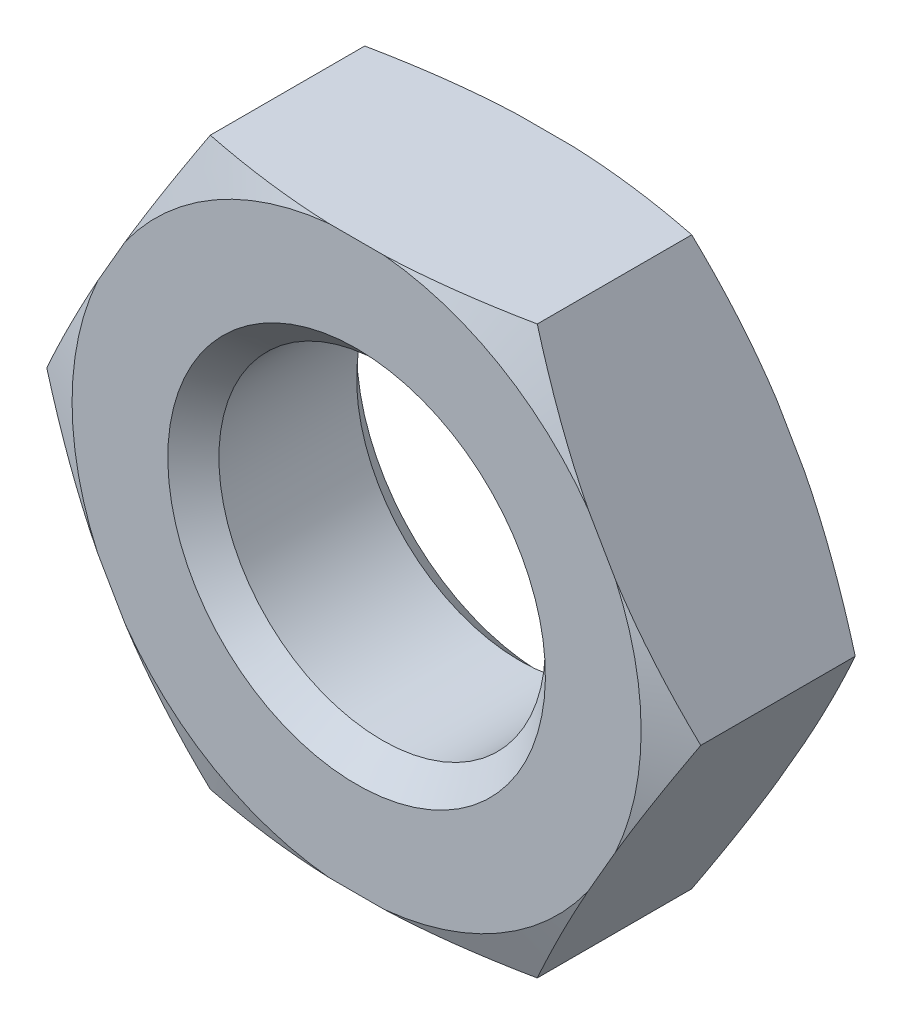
ISO-10303-21;
HEADER;
FILE_DESCRIPTION(('STEP AP214'),'2;1');
FILE_NAME('part.step','',(''),(''),'','','');
FILE_SCHEMA(('AUTOMOTIVE_DESIGN { 1 0 10303 214 1 1 1 1 }'));
ENDSEC;
DATA;
#1=APPLICATION_CONTEXT('core data for automotive mechanical design processes');
#2=APPLICATION_PROTOCOL_DEFINITION('international standard','automotive_design',2000,#1);
#3=PRODUCT_CONTEXT('',#1,'mechanical');
#4=PRODUCT('Part','Part','',(#3));
#5=PRODUCT_RELATED_PRODUCT_CATEGORY('part','',(#4));
#6=PRODUCT_DEFINITION_FORMATION('','',#4);
#7=PRODUCT_DEFINITION_CONTEXT('part definition',#1,'design');
#8=PRODUCT_DEFINITION('design','',#6,#7);
#9=PRODUCT_DEFINITION_SHAPE('','',#8);
#10=(LENGTH_UNIT() NAMED_UNIT(*) SI_UNIT(.MILLI.,.METRE.));
#11=(NAMED_UNIT(*) PLANE_ANGLE_UNIT() SI_UNIT($,.RADIAN.));
#12=(NAMED_UNIT(*) SI_UNIT($,.STERADIAN.) SOLID_ANGLE_UNIT());
#13=UNCERTAINTY_MEASURE_WITH_UNIT(LENGTH_MEASURE(1.E-05),#10,'distance_accuracy_value','');
#14=(GEOMETRIC_REPRESENTATION_CONTEXT(3) GLOBAL_UNCERTAINTY_ASSIGNED_CONTEXT((#13)) GLOBAL_UNIT_ASSIGNED_CONTEXT((#10,
#11,#12)) REPRESENTATION_CONTEXT('',''));
#15=CARTESIAN_POINT('',(0.,0.,0.));
#16=DIRECTION('',(0.,0.,1.));
#17=DIRECTION('',(1.,0.,0.));
#18=AXIS2_PLACEMENT_3D('',#15,#16,#17);
#19=CARTESIAN_POINT('',(0.,0.,0.));
#20=DIRECTION('',(0.,0.,1.));
#21=DIRECTION('',(0.,-1.,0.));
#22=AXIS2_PLACEMENT_3D('',#19,#20,#21);
#23=CONICAL_SURFACE('',#22,12.0563368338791,1.18682389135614);
#24=CARTESIAN_POINT('',(4.39117213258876,16.3942555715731,1.98611902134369));
#25=CARTESIAN_POINT('',(4.51023033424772,16.188040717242,1.91808794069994));
#26=CARTESIAN_POINT('',(4.62942129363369,15.9815959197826,1.85098728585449));
#27=CARTESIAN_POINT('',(4.8680921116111,15.5682059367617,1.7188514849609));
#28=CARTESIAN_POINT('',(4.98757197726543,15.3612607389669,1.65381638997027));
#29=CARTESIAN_POINT('',(5.34653845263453,14.7395125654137,1.46208549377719));
#30=CARTESIAN_POINT('',(5.5864850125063,14.3239129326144,1.33880257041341));
#31=CARTESIAN_POINT('',(6.06892578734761,13.4883009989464,1.10274926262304));
#32=CARTESIAN_POINT('',(6.31142672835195,13.0682770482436,0.990033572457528));
#33=CARTESIAN_POINT('',(6.797905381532,12.2256713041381,0.778225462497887));
#34=CARTESIAN_POINT('',(7.04188298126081,11.8030897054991,0.679132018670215));
#35=CARTESIAN_POINT('',(7.52501763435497,10.9662759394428,0.499675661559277));
#36=CARTESIAN_POINT('',(7.7641353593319,10.5521118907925,0.418893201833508));
#37=CARTESIAN_POINT('',(8.24375068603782,9.72139377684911,0.275565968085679));
#38=CARTESIAN_POINT('',(8.48424828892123,9.30483970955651,0.21302120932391));
#39=CARTESIAN_POINT('',(8.9658252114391,8.47072401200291,0.10885701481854));
#40=CARTESIAN_POINT('',(9.20690188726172,8.05316696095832,0.0671893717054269));
#41=CARTESIAN_POINT('',(9.68977109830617,7.21681295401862,0.00655433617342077));
#42=CARTESIAN_POINT('',(9.93156360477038,6.79801604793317,-0.0124139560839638));
#43=CARTESIAN_POINT('',(10.4031066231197,5.98127958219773,-0.0263052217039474));
#44=CARTESIAN_POINT('',(10.6328486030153,5.58335480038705,-0.0223941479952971));
#45=CARTESIAN_POINT('',(11.091996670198,4.78808701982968,0.00658630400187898));
#46=CARTESIAN_POINT('',(11.3214027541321,4.39074402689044,0.0316558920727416));
#47=CARTESIAN_POINT('',(11.7799140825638,3.59657911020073,0.10187006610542));
#48=CARTESIAN_POINT('',(12.0090177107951,3.19975998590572,0.147056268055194));
#49=CARTESIAN_POINT('',(12.4661307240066,2.40801702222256,0.255631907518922));
#50=CARTESIAN_POINT('',(12.6941401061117,2.01309318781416,0.319021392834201));
#51=CARTESIAN_POINT('',(13.1545430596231,1.21565188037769,0.463527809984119));
#52=CARTESIAN_POINT('',(13.3869048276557,0.813189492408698,0.545046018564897));
#53=CARTESIAN_POINT('',(13.8502703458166,0.010616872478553,0.722366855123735));
#54=CARTESIAN_POINT('',(14.0812739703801,-0.389493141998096,0.81817078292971));
#55=CARTESIAN_POINT('',(14.5410132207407,-1.18578488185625,1.02133226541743));
#56=CARTESIAN_POINT('',(14.7697542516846,-1.5819759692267,1.12864117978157));
#57=CARTESIAN_POINT('',(15.1119090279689,-2.17460542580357,1.29699013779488));
#58=CARTESIAN_POINT('',(15.225783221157,-2.3718413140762,1.35432773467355));
#59=CARTESIAN_POINT('',(15.4532388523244,-2.76580602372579,1.47125419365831));
#60=CARTESIAN_POINT('',(15.5668202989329,-2.96253486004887,1.53084298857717));
#61=CARTESIAN_POINT('',(15.680265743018,-3.1590281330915,1.59145162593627));
#62=B_SPLINE_CURVE_WITH_KNOTS('',3,(#24,#25,#26,#27,#28,#29,#30,#31,#32,#33,#34,#35,#36,#37,#38,
#39,#40,#41,#42,#43,#44,#45,#46,#47,#48,#49,#50,#51,#52,#53,#54,#55,#56,#57,#58,#59,#60,#61),
.UNSPECIFIED.,.F.,.F.,(4,2,2,2,2,2,2,2,2,2,2,2,2,2,2,2,2,2,4),(0.,0.742929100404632,
1.4858765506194,2.97218923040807,4.46581308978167,5.95932460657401,7.41405543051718,
8.86878747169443,10.3201447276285,11.7714444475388,13.149451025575,14.5274712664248,
15.9083556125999,17.2892435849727,18.7044365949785,20.1197584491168,21.5293164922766,
22.2338726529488,22.9384078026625),.UNSPECIFIED.);
#63=CARTESIAN_POINT('',(10.9744065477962,4.99175908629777,0.));
#64=VERTEX_POINT('',#63);
#65=CARTESIAN_POINT('',(13.8564,0.,0.727272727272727));
#66=VERTEX_POINT('',#65);
#67=EDGE_CURVE('E294',#64,#66,#62,.T.);
#68=ORIENTED_EDGE('',*,*,#67,.T.);
#69=CARTESIAN_POINT('',(15.680265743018,3.1590281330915,1.59145162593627));
#70=CARTESIAN_POINT('',(15.5668202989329,2.96253486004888,1.53084298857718));
#71=CARTESIAN_POINT('',(15.4532388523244,2.7658060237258,1.47125419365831));
#72=CARTESIAN_POINT('',(15.225783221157,2.3718413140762,1.35432773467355));
#73=CARTESIAN_POINT('',(15.1119090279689,2.17460542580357,1.29699013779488));
#74=CARTESIAN_POINT('',(14.7697542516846,1.5819759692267,1.12864117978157));
#75=CARTESIAN_POINT('',(14.5410132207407,1.18578488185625,1.02133226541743));
#76=CARTESIAN_POINT('',(14.0812739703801,0.389493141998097,0.818170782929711));
#77=CARTESIAN_POINT('',(13.8502703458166,-0.010616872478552,0.722366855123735));
#78=CARTESIAN_POINT('',(13.3869048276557,-0.813189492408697,0.545046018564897));
#79=CARTESIAN_POINT('',(13.1545430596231,-1.21565188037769,0.463527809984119));
#80=CARTESIAN_POINT('',(12.6941401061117,-2.01309318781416,0.319021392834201));
#81=CARTESIAN_POINT('',(12.4661307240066,-2.40801702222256,0.255631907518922));
#82=CARTESIAN_POINT('',(12.0090177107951,-3.19975998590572,0.147056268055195));
#83=CARTESIAN_POINT('',(11.7799140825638,-3.59657911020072,0.10187006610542));
#84=CARTESIAN_POINT('',(11.3214027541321,-4.39074402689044,0.0316558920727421));
#85=CARTESIAN_POINT('',(11.091996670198,-4.78808701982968,0.00658630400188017));
#86=CARTESIAN_POINT('',(10.6328486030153,-5.58335480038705,-0.0223941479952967));
#87=CARTESIAN_POINT('',(10.4031066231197,-5.98127958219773,-0.0263052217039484));
#88=CARTESIAN_POINT('',(9.93156360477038,-6.79801604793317,-0.0124139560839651));
#89=CARTESIAN_POINT('',(9.68977109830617,-7.21681295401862,0.00655433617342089));
#90=CARTESIAN_POINT('',(9.20690188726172,-8.05316696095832,0.0671893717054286));
#91=CARTESIAN_POINT('',(8.96582521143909,-8.47072401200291,0.108857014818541));
#92=CARTESIAN_POINT('',(8.48424828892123,-9.30483970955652,0.213021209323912));
#93=CARTESIAN_POINT('',(8.24375068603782,-9.72139377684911,0.275565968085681));
#94=CARTESIAN_POINT('',(7.7641353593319,-10.5521118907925,0.41889320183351));
#95=CARTESIAN_POINT('',(7.52501763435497,-10.9662759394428,0.49967566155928));
#96=CARTESIAN_POINT('',(7.0418829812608,-11.8030897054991,0.679132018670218));
#97=CARTESIAN_POINT('',(6.797905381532,-12.2256713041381,0.77822546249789));
#98=CARTESIAN_POINT('',(6.31142672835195,-13.0682770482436,0.990033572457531));
#99=CARTESIAN_POINT('',(6.06892578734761,-13.4883009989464,1.10274926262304));
#100=CARTESIAN_POINT('',(5.5864850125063,-14.3239129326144,1.33880257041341));
#101=CARTESIAN_POINT('',(5.34653845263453,-14.7395125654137,1.4620854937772));
#102=CARTESIAN_POINT('',(4.98757197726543,-15.3612607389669,1.65381638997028));
#103=CARTESIAN_POINT('',(4.8680921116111,-15.5682059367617,1.7188514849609));
#104=CARTESIAN_POINT('',(4.62942129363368,-15.9815959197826,1.85098728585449));
#105=CARTESIAN_POINT('',(4.51023033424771,-16.188040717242,1.91808794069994));
#106=CARTESIAN_POINT('',(4.39117213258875,-16.3942555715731,1.9861190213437));
#107=B_SPLINE_CURVE_WITH_KNOTS('',3,(#69,#70,#71,#72,#73,#74,#75,#76,#77,#78,#79,#80,#81,#82,
#83,#84,#85,#86,#87,#88,#89,#90,#91,#92,#93,#94,#95,#96,#97,#98,#99,#100,#101,#102,#103,#104,
#105,#106),.UNSPECIFIED.,.F.,.F.,(4,2,2,2,2,2,2,2,2,2,2,2,2,2,2,2,2,2,4),(0.,0.704535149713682,
1.40909131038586,2.8186493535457,4.23397120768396,5.64916421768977,7.03005219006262,
8.41093653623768,9.78895677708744,11.1669633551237,12.618263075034,14.0696203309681,
15.5243523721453,16.9790831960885,18.4725947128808,19.9662185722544,21.4525312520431,
22.1954787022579,22.9384078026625),.UNSPECIFIED.);
#108=CARTESIAN_POINT('',(10.9744065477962,-4.99175908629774,0.));
#109=VERTEX_POINT('',#108);
#110=EDGE_CURVE('E33',#66,#109,#107,.T.);
#111=ORIENTED_EDGE('',*,*,#110,.T.);
#112=CARTESIAN_POINT('',(0.,0.,0.));
#113=DIRECTION('',(0.,0.,1.));
#114=DIRECTION('',(1.,0.,0.));
#115=AXIS2_PLACEMENT_3D('',#112,#113,#114);
#116=CIRCLE('',#115,12.0563368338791);
#117=EDGE_CURVE('E299',#109,#64,#116,.T.);
#118=ORIENTED_EDGE('',*,*,#117,.T.);
#119=EDGE_LOOP('',(#68,#111,#118));
#120=FACE_BOUND('',#119,.T.);
#121=ADVANCED_FACE('F16',(#120),#23,.T.);
#122=CARTESIAN_POINT('',(13.8564,0.,0.));
#123=DIRECTION('',(0.,0.,1.));
#124=DIRECTION('',(1.,0.,0.));
#125=AXIS2_PLACEMENT_3D('',#122,#123,#124);
#126=PLANE('',#125);
#127=CARTESIAN_POINT('',(0.,0.,0.));
#128=DIRECTION('',(0.,0.,-1.));
#129=DIRECTION('',(0.,1.,0.));
#130=AXIS2_PLACEMENT_3D('',#127,#128,#129);
#131=CIRCLE('',#130,12.0563368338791);
#132=CARTESIAN_POINT('',(1.16421309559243,11.9999944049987,0.));
#133=VERTEX_POINT('',#132);
#134=CARTESIAN_POINT('',(9.81019345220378,7.00823531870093,0.));
#135=VERTEX_POINT('',#134);
#136=EDGE_CURVE('E151',#133,#135,#131,.T.);
#137=ORIENTED_EDGE('',*,*,#136,.T.);
#138=DIRECTION('',(-0.5,0.866025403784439,0.));
#139=VECTOR('',#138,1.);
#140=CARTESIAN_POINT('',(13.8564,0.,0.));
#141=LINE('',#140,#139);
#142=EDGE_CURVE('E157',#64,#135,#141,.T.);
#143=ORIENTED_EDGE('',*,*,#142,.F.);
#144=ORIENTED_EDGE('',*,*,#117,.F.);
#145=DIRECTION('',(0.5,0.866025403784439,0.));
#146=VECTOR('',#145,1.);
#147=CARTESIAN_POINT('',(6.9282,-11.9999944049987,0.));
#148=LINE('',#147,#146);
#149=CARTESIAN_POINT('',(9.81019345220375,-7.00823531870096,0.));
#150=VERTEX_POINT('',#149);
#151=EDGE_CURVE('E340',#150,#109,#148,.T.);
#152=ORIENTED_EDGE('',*,*,#151,.F.);
#153=CARTESIAN_POINT('',(1.1642130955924,-11.9999944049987,0.));
#154=VERTEX_POINT('',#153);
#155=EDGE_CURVE('E306',#154,#150,#116,.T.);
#156=ORIENTED_EDGE('',*,*,#155,.F.);
#157=DIRECTION('',(1.,0.,0.));
#158=VECTOR('',#157,1.);
#159=CARTESIAN_POINT('',(-6.9282,-11.9999944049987,0.));
#160=LINE('',#159,#158);
#161=CARTESIAN_POINT('',(-1.16421309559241,-11.9999944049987,0.));
#162=VERTEX_POINT('',#161);
#163=EDGE_CURVE('E326',#162,#154,#160,.T.);
#164=ORIENTED_EDGE('',*,*,#163,.F.);
#165=CARTESIAN_POINT('',(-9.81019345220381,-7.00823531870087,0.));
#166=VERTEX_POINT('',#165);
#167=EDGE_CURVE('E379',#166,#162,#116,.T.);
#168=ORIENTED_EDGE('',*,*,#167,.F.);
#169=DIRECTION('',(0.5,-0.866025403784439,0.));
#170=VECTOR('',#169,1.);
#171=CARTESIAN_POINT('',(-13.8564,0.,0.));
#172=LINE('',#171,#170);
#173=CARTESIAN_POINT('',(-10.9744065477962,-4.99175908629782,0.));
#174=VERTEX_POINT('',#173);
#175=EDGE_CURVE('E345',#174,#166,#172,.T.);
#176=ORIENTED_EDGE('',*,*,#175,.F.);
#177=CARTESIAN_POINT('',(-10.9744065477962,4.99175908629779,0.));
#178=VERTEX_POINT('',#177);
#179=EDGE_CURVE('E357',#178,#174,#116,.T.);
#180=ORIENTED_EDGE('',*,*,#179,.F.);
#181=DIRECTION('',(-0.5,-0.866025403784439,0.));
#182=VECTOR('',#181,1.);
#183=CARTESIAN_POINT('',(-6.9282,11.9999944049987,0.));
#184=LINE('',#183,#182);
#185=CARTESIAN_POINT('',(-9.81019345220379,7.00823531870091,0.));
#186=VERTEX_POINT('',#185);
#187=EDGE_CURVE('E156',#186,#178,#184,.T.);
#188=ORIENTED_EDGE('',*,*,#187,.F.);
#189=CARTESIAN_POINT('',(-1.16421309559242,11.9999944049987,0.));
#190=VERTEX_POINT('',#189);
#191=EDGE_CURVE('E153',#190,#186,#116,.T.);
#192=ORIENTED_EDGE('',*,*,#191,.F.);
#193=DIRECTION('',(-1.,0.,0.));
#194=VECTOR('',#193,1.);
#195=CARTESIAN_POINT('',(6.9282,11.9999944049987,0.));
#196=LINE('',#195,#194);
#197=EDGE_CURVE('E146',#133,#190,#196,.T.);
#198=ORIENTED_EDGE('',*,*,#197,.F.);
#199=EDGE_LOOP('',(#137,#143,#144,#152,#156,#164,#168,#176,#180,#188,#192,#198));
#200=FACE_BOUND('',#199,.T.);
#201=CARTESIAN_POINT('',(0.,0.,0.));
#202=DIRECTION('',(0.,0.,-1.));
#203=DIRECTION('',(0.,1.,0.));
#204=AXIS2_PLACEMENT_3D('',#201,#202,#203);
#205=CIRCLE('',#204,8.);
#206=CARTESIAN_POINT('',(0.,8.,0.));
#207=VERTEX_POINT('',#206);
#208=EDGE_CURVE('E169',#207,#207,#205,.T.);
#209=ORIENTED_EDGE('',*,*,#208,.F.);
#210=EDGE_LOOP('',(#209));
#211=FACE_BOUND('',#210,.T.);
#212=ADVANCED_FACE('F148',(#200,#211),#126,.F.);
#213=CARTESIAN_POINT('',(6.9282,-11.9999944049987,8.));
#214=DIRECTION('',(-0.866025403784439,0.5,0.));
#215=DIRECTION('',(-0.5,-0.866025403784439,0.));
#216=AXIS2_PLACEMENT_3D('',#213,#214,#215);
#217=PLANE('',#216);
#218=CARTESIAN_POINT('',(4.39117213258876,-16.394255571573,6.01388097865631));
#219=CARTESIAN_POINT('',(4.51023033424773,-16.188040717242,6.08191205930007));
#220=CARTESIAN_POINT('',(4.6294212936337,-15.9815959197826,6.14901271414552));
#221=CARTESIAN_POINT('',(4.86809211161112,-15.5682059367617,6.28114851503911));
#222=CARTESIAN_POINT('',(4.98757197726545,-15.3612607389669,6.34618361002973));
#223=CARTESIAN_POINT('',(5.34653845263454,-14.7395125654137,6.53791450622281));
#224=CARTESIAN_POINT('',(5.58648501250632,-14.3239129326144,6.66119742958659));
#225=CARTESIAN_POINT('',(6.06892578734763,-13.4883009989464,6.89725073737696));
#226=CARTESIAN_POINT('',(6.31142672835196,-13.0682770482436,7.00996642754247));
#227=CARTESIAN_POINT('',(6.79790538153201,-12.2256713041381,7.22177453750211));
#228=CARTESIAN_POINT('',(7.04188298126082,-11.8030897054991,7.32086798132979));
#229=CARTESIAN_POINT('',(7.52501763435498,-10.9662759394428,7.50032433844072));
#230=CARTESIAN_POINT('',(7.76413535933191,-10.5521118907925,7.58110679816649));
#231=CARTESIAN_POINT('',(8.24375068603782,-9.72139377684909,7.72443403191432));
#232=CARTESIAN_POINT('',(8.48424828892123,-9.3048397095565,7.78697879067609));
#233=CARTESIAN_POINT('',(8.9658252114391,-8.4707240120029,7.89114298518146));
#234=CARTESIAN_POINT('',(9.20690188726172,-8.05316696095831,7.93281062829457));
#235=CARTESIAN_POINT('',(9.68977109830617,-7.21681295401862,7.99344566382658));
#236=CARTESIAN_POINT('',(9.93156360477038,-6.79801604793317,8.01241395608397));
#237=CARTESIAN_POINT('',(10.4031066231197,-5.98127958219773,8.02630522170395));
#238=CARTESIAN_POINT('',(10.6328486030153,-5.58335480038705,8.02239414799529));
#239=CARTESIAN_POINT('',(11.091996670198,-4.78808701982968,7.99341369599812));
#240=CARTESIAN_POINT('',(11.3214027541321,-4.39074402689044,7.96834410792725));
#241=CARTESIAN_POINT('',(11.7799140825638,-3.59657911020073,7.89812993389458));
#242=CARTESIAN_POINT('',(12.0090177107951,-3.19975998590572,7.8529437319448));
#243=CARTESIAN_POINT('',(12.4661307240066,-2.40801702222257,7.74436809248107));
#244=CARTESIAN_POINT('',(12.6941401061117,-2.01309318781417,7.6809786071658));
#245=CARTESIAN_POINT('',(13.1545430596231,-1.21565188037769,7.53647219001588));
#246=CARTESIAN_POINT('',(13.3869048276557,-0.8131894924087,7.4549539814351));
#247=CARTESIAN_POINT('',(13.8502703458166,-0.0106168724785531,7.27763314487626));
#248=CARTESIAN_POINT('',(14.0812739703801,0.389493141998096,7.18182921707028));
#249=CARTESIAN_POINT('',(14.5410132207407,1.18578488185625,6.97866773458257));
#250=CARTESIAN_POINT('',(14.7697542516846,1.5819759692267,6.87135882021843));
#251=CARTESIAN_POINT('',(15.1119090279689,2.17460542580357,6.70300986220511));
#252=CARTESIAN_POINT('',(15.225783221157,2.3718413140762,6.64567226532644));
#253=CARTESIAN_POINT('',(15.4532388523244,2.76580602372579,6.52874580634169));
#254=CARTESIAN_POINT('',(15.5668202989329,2.96253486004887,6.46915701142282));
#255=CARTESIAN_POINT('',(15.680265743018,3.15902813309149,6.40854837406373));
#256=B_SPLINE_CURVE_WITH_KNOTS('',3,(#218,#219,#220,#221,#222,#223,#224,#225,#226,#227,#228,
#229,#230,#231,#232,#233,#234,#235,#236,#237,#238,#239,#240,#241,#242,#243,#244,#245,#246,#247,
#248,#249,#250,#251,#252,#253,#254,#255),.UNSPECIFIED.,.F.,.F.,(4,2,2,2,2,2,2,2,2,2,2,2,2,2,2,2,
2,2,4),(0.,0.74292910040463,1.48587655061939,2.97218923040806,4.46581308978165,5.95932460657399,
7.41405543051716,8.8687874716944,10.3201447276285,11.7714444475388,13.149451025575,
14.5274712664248,15.9083556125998,17.2892435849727,18.7044365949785,20.1197584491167,
21.5293164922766,22.2338726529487,22.9384078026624),.UNSPECIFIED.);
#257=CARTESIAN_POINT('',(6.9282,-11.9999944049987,7.27272727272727));
#258=VERTEX_POINT('',#257);
#259=CARTESIAN_POINT('',(9.81019345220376,-7.00823531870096,8.));
#260=VERTEX_POINT('',#259);
#261=EDGE_CURVE('E219',#258,#260,#256,.T.);
#262=ORIENTED_EDGE('',*,*,#261,.F.);
#263=DIRECTION('',(0.,0.,-1.));
#264=VECTOR('',#263,1.);
#265=CARTESIAN_POINT('',(6.9282,-11.9999944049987,8.));
#266=LINE('',#265,#264);
#267=CARTESIAN_POINT('',(6.9282,-11.9999944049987,0.727272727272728));
#268=VERTEX_POINT('',#267);
#269=EDGE_CURVE('E318',#258,#268,#266,.T.);
#270=ORIENTED_EDGE('',*,*,#269,.T.);
#271=EDGE_CURVE('E284',#150,#268,#107,.T.);
#272=ORIENTED_EDGE('',*,*,#271,.F.);
#273=ORIENTED_EDGE('',*,*,#151,.T.);
#274=ORIENTED_EDGE('',*,*,#110,.F.);
#275=DIRECTION('',(0.,0.,-1.));
#276=VECTOR('',#275,1.);
#277=CARTESIAN_POINT('',(13.8564,0.,8.));
#278=LINE('',#277,#276);
#279=CARTESIAN_POINT('',(13.8564,0.,7.27272727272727));
#280=VERTEX_POINT('',#279);
#281=EDGE_CURVE('E301',#280,#66,#278,.T.);
#282=ORIENTED_EDGE('',*,*,#281,.F.);
#283=CARTESIAN_POINT('',(10.9744065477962,-4.99175908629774,8.));
#284=VERTEX_POINT('',#283);
#285=EDGE_CURVE('E342',#284,#280,#256,.T.);
#286=ORIENTED_EDGE('',*,*,#285,.F.);
#287=DIRECTION('',(0.5,0.866025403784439,0.));
#288=VECTOR('',#287,1.);
#289=CARTESIAN_POINT('',(6.9282,-11.9999944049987,8.));
#290=LINE('',#289,#288);
#291=EDGE_CURVE('E322',#260,#284,#290,.T.);
#292=ORIENTED_EDGE('',*,*,#291,.F.);
#293=EDGE_LOOP('',(#262,#270,#272,#273,#274,#282,#286,#292));
#294=FACE_BOUND('',#293,.T.);
#295=ADVANCED_FACE('F18',(#294),#217,.F.);
#296=CARTESIAN_POINT('',(13.8564,0.,8.));
#297=DIRECTION('',(-0.866025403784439,-0.5,0.));
#298=DIRECTION('',(0.5,-0.866025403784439,0.));
#299=AXIS2_PLACEMENT_3D('',#296,#297,#298);
#300=PLANE('',#299);
#301=CARTESIAN_POINT('',(15.680265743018,-3.15902813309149,6.40854837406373));
#302=CARTESIAN_POINT('',(15.5668202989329,-2.96253486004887,6.46915701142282));
#303=CARTESIAN_POINT('',(15.4532388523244,-2.76580602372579,6.52874580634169));
#304=CARTESIAN_POINT('',(15.225783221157,-2.3718413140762,6.64567226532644));
#305=CARTESIAN_POINT('',(15.1119090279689,-2.17460542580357,6.70300986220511));
#306=CARTESIAN_POINT('',(14.7697542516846,-1.5819759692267,6.87135882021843));
#307=CARTESIAN_POINT('',(14.5410132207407,-1.18578488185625,6.97866773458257));
#308=CARTESIAN_POINT('',(14.0812739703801,-0.389493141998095,7.18182921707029));
#309=CARTESIAN_POINT('',(13.8502703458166,0.010616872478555,7.27763314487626));
#310=CARTESIAN_POINT('',(13.3869048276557,0.813189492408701,7.4549539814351));
#311=CARTESIAN_POINT('',(13.1545430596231,1.21565188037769,7.53647219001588));
#312=CARTESIAN_POINT('',(12.6941401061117,2.01309318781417,7.6809786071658));
#313=CARTESIAN_POINT('',(12.4661307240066,2.40801702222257,7.74436809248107));
#314=CARTESIAN_POINT('',(12.0090177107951,3.19975998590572,7.8529437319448));
#315=CARTESIAN_POINT('',(11.7799140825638,3.59657911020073,7.89812993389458));
#316=CARTESIAN_POINT('',(11.3214027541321,4.39074402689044,7.96834410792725));
#317=CARTESIAN_POINT('',(11.091996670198,4.78808701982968,7.99341369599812));
#318=CARTESIAN_POINT('',(10.6328486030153,5.58335480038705,8.02239414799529));
#319=CARTESIAN_POINT('',(10.4031066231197,5.98127958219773,8.02630522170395));
#320=CARTESIAN_POINT('',(9.93156360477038,6.79801604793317,8.01241395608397));
#321=CARTESIAN_POINT('',(9.68977109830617,7.21681295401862,7.99344566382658));
#322=CARTESIAN_POINT('',(9.20690188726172,8.05316696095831,7.93281062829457));
#323=CARTESIAN_POINT('',(8.9658252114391,8.4707240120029,7.89114298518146));
#324=CARTESIAN_POINT('',(8.48424828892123,9.3048397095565,7.78697879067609));
#325=CARTESIAN_POINT('',(8.24375068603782,9.7213937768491,7.72443403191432));
#326=CARTESIAN_POINT('',(7.76413535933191,10.5521118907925,7.58110679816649));
#327=CARTESIAN_POINT('',(7.52501763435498,10.9662759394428,7.50032433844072));
#328=CARTESIAN_POINT('',(7.04188298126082,11.8030897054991,7.32086798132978));
#329=CARTESIAN_POINT('',(6.79790538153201,12.2256713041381,7.22177453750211));
#330=CARTESIAN_POINT('',(6.31142672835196,13.0682770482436,7.00996642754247));
#331=CARTESIAN_POINT('',(6.06892578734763,13.4883009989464,6.89725073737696));
#332=CARTESIAN_POINT('',(5.58648501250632,14.3239129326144,6.66119742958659));
#333=CARTESIAN_POINT('',(5.34653845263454,14.7395125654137,6.53791450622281));
#334=CARTESIAN_POINT('',(4.98757197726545,15.3612607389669,6.34618361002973));
#335=CARTESIAN_POINT('',(4.86809211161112,15.5682059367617,6.28114851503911));
#336=CARTESIAN_POINT('',(4.62942129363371,15.9815959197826,6.14901271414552));
#337=CARTESIAN_POINT('',(4.51023033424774,16.188040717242,6.08191205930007));
#338=CARTESIAN_POINT('',(4.39117213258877,16.394255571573,6.01388097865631));
#339=B_SPLINE_CURVE_WITH_KNOTS('',3,(#301,#302,#303,#304,#305,#306,#307,#308,#309,#310,#311,
#312,#313,#314,#315,#316,#317,#318,#319,#320,#321,#322,#323,#324,#325,#326,#327,#328,#329,#330,
#331,#332,#333,#334,#335,#336,#337,#338),.UNSPECIFIED.,.F.,.F.,(4,2,2,2,2,2,2,2,2,2,2,2,2,2,2,2,
2,2,4),(0.,0.704535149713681,1.40909131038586,2.81864935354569,4.23397120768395,
5.64916421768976,7.03005219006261,8.41093653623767,9.78895677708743,11.1669633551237,
12.618263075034,14.069620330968,15.5243523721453,16.9790831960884,18.4725947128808,
19.9662185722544,21.452531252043,22.1954787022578,22.9384078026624),.UNSPECIFIED.);
#340=CARTESIAN_POINT('',(10.9744065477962,4.99175908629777,8.));
#341=VERTEX_POINT('',#340);
#342=EDGE_CURVE('E303',#280,#341,#339,.T.);
#343=ORIENTED_EDGE('',*,*,#342,.F.);
#344=ORIENTED_EDGE('',*,*,#281,.T.);
#345=ORIENTED_EDGE('',*,*,#67,.F.);
#346=ORIENTED_EDGE('',*,*,#142,.T.);
#347=CARTESIAN_POINT('',(6.9282,11.9999944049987,0.727272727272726));
#348=VERTEX_POINT('',#347);
#349=EDGE_CURVE('E41',#348,#135,#62,.T.);
#350=ORIENTED_EDGE('',*,*,#349,.F.);
#351=DIRECTION('',(0.,0.,-1.));
#352=VECTOR('',#351,1.);
#353=CARTESIAN_POINT('',(6.9282,11.9999944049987,8.));
#354=LINE('',#353,#352);
#355=CARTESIAN_POINT('',(6.9282,11.9999944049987,7.27272727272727));
#356=VERTEX_POINT('',#355);
#357=EDGE_CURVE('E163',#356,#348,#354,.T.);
#358=ORIENTED_EDGE('',*,*,#357,.F.);
#359=CARTESIAN_POINT('',(9.81019345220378,7.00823531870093,8.));
#360=VERTEX_POINT('',#359);
#361=EDGE_CURVE('E261',#360,#356,#339,.T.);
#362=ORIENTED_EDGE('',*,*,#361,.F.);
#363=DIRECTION('',(-0.5,0.866025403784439,0.));
#364=VECTOR('',#363,1.);
#365=CARTESIAN_POINT('',(13.8564,0.,8.));
#366=LINE('',#365,#364);
#367=EDGE_CURVE('E325',#341,#360,#366,.T.);
#368=ORIENTED_EDGE('',*,*,#367,.F.);
#369=EDGE_LOOP('',(#343,#344,#345,#346,#350,#358,#362,#368));
#370=FACE_BOUND('',#369,.T.);
#371=ADVANCED_FACE('F269',(#370),#300,.F.);
#372=CARTESIAN_POINT('',(6.9282,11.9999944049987,8.));
#373=DIRECTION('',(0.,-1.,0.));
#374=DIRECTION('',(1.,0.,0.));
#375=AXIS2_PLACEMENT_3D('',#372,#373,#374);
#376=PLANE('',#375);
#377=CARTESIAN_POINT('',(-18.3557334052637,11.9999944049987,4.01070822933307));
#378=CARTESIAN_POINT('',(-18.0848925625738,11.9999944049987,4.10229741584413));
#379=CARTESIAN_POINT('',(-17.8138688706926,11.9999944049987,4.19334560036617));
#380=CARTESIAN_POINT('',(-17.2714179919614,11.9999944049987,4.3742379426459));
#381=CARTESIAN_POINT('',(-16.999990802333,11.9999944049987,4.46408209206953));
#382=CARTESIAN_POINT('',(-16.185003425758,11.9999944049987,4.73163980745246));
#383=CARTESIAN_POINT('',(-15.6407867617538,11.9999944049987,4.9073619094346));
#384=CARTESIAN_POINT('',(-14.5489723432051,11.9999944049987,5.25267174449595));
#385=CARTESIAN_POINT('',(-14.0013696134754,11.9999944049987,5.42224378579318));
#386=CARTESIAN_POINT('',(-12.9036986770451,11.9999944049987,5.75319625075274));
#387=CARTESIAN_POINT('',(-12.3536305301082,11.9999944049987,5.91457687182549));
#388=CARTESIAN_POINT('',(-11.257605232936,11.9999944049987,6.22508668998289));
#389=CARTESIAN_POINT('',(-10.7116850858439,11.9999944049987,6.3743458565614));
#390=CARTESIAN_POINT('',(-9.61653010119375,11.9999944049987,6.66032570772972));
#391=CARTESIAN_POINT('',(-9.06729516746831,11.9999944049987,6.79704602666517));
#392=CARTESIAN_POINT('',(-7.9654227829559,11.9999944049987,7.0546967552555));
#393=CARTESIAN_POINT('',(-7.41278737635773,11.9999944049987,7.17563583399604));
#394=CARTESIAN_POINT('',(-6.30358631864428,11.9999944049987,7.39799839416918));
#395=CARTESIAN_POINT('',(-5.74702095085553,11.9999944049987,7.49942326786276));
#396=CARTESIAN_POINT('',(-4.74420927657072,11.9999944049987,7.66021614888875));
#397=CARTESIAN_POINT('',(-4.29866547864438,11.9999944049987,7.72394310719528));
#398=CARTESIAN_POINT('',(-3.40544299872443,11.9999944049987,7.83424171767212));
#399=CARTESIAN_POINT('',(-2.957764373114,11.9999944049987,7.8808138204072));
#400=CARTESIAN_POINT('',(-2.06111135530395,11.9999944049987,7.95496023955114));
#401=CARTESIAN_POINT('',(-1.61213800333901,11.9999944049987,7.98254697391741));
#402=CARTESIAN_POINT('',(-0.713398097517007,11.9999944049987,8.01756571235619));
#403=CARTESIAN_POINT('',(-0.26363155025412,11.9999944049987,8.0249978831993));
#404=CARTESIAN_POINT('',(0.637926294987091,11.9999944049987,8.01935064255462));
#405=CARTESIAN_POINT('',(1.08971696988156,11.9999944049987,8.00617279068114));
#406=CARTESIAN_POINT('',(1.99225674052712,11.9999944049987,7.95973031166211));
#407=CARTESIAN_POINT('',(2.44300581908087,11.9999944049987,7.92646535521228));
#408=CARTESIAN_POINT('',(3.34300242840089,11.9999944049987,7.84125128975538));
#409=CARTESIAN_POINT('',(3.79224881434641,11.9999944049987,7.78929024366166));
#410=CARTESIAN_POINT('',(4.68846266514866,11.9999944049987,7.66865323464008));
#411=CARTESIAN_POINT('',(5.135430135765,11.9999944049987,7.59997731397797));
#412=CARTESIAN_POINT('',(6.10037686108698,11.9999944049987,7.43556908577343));
#413=CARTESIAN_POINT('',(6.61791118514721,11.9999944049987,7.33724256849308));
#414=CARTESIAN_POINT('',(7.64963059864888,11.9999944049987,7.12423863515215));
#415=CARTESIAN_POINT('',(8.16381526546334,11.9999944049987,7.00955919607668));
#416=CARTESIAN_POINT('',(9.18925976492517,11.9999944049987,6.76680789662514));
#417=CARTESIAN_POINT('',(9.70051801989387,11.9999944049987,6.63872942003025));
#418=CARTESIAN_POINT('',(10.720166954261,11.9999944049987,6.37176347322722));
#419=CARTESIAN_POINT('',(11.2285577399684,11.9999944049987,6.23287640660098));
#420=CARTESIAN_POINT('',(12.2441945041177,11.9999944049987,5.94596733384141));
#421=CARTESIAN_POINT('',(12.7514339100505,11.9999944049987,5.79792216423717));
#422=CARTESIAN_POINT('',(13.763767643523,11.9999944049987,5.49468342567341));
#423=CARTESIAN_POINT('',(14.268861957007,11.9999944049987,5.33948980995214));
#424=CARTESIAN_POINT('',(15.2770787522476,11.9999944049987,5.02330970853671));
#425=CARTESIAN_POINT('',(15.780201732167,11.9999944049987,4.86232480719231));
#426=CARTESIAN_POINT('',(16.7848830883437,11.9999944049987,4.53556004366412));
#427=CARTESIAN_POINT('',(17.2864414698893,11.9999944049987,4.36978019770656));
#428=CARTESIAN_POINT('',(18.2850148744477,11.9999944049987,4.03532515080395));
#429=CARTESIAN_POINT('',(18.7820384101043,11.9999944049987,3.86667532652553));
#430=CARTESIAN_POINT('',(19.774961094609,11.9999944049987,3.52609484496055));
#431=CARTESIAN_POINT('',(20.2708602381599,11.9999944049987,3.35416417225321));
#432=CARTESIAN_POINT('',(21.7571849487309,11.9999944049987,2.83423109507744));
#433=CARTESIAN_POINT('',(22.7461698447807,11.9999944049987,2.48211055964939));
#434=CARTESIAN_POINT('',(24.7147044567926,11.9999944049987,1.77232570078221));
#435=CARTESIAN_POINT('',(25.6942731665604,11.9999944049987,1.41471385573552));
#436=CARTESIAN_POINT('',(27.1619470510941,11.9999944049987,0.873938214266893));
#437=CARTESIAN_POINT('',(27.6508609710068,11.9999944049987,0.692964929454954));
#438=CARTESIAN_POINT('',(28.6282107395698,11.9999944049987,0.32973725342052));
#439=CARTESIAN_POINT('',(29.1166465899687,11.9999944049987,0.147482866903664));
#440=CARTESIAN_POINT('',(29.6048756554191,11.9999944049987,-0.0353233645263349));
#441=B_SPLINE_CURVE_WITH_KNOTS('',3,(#377,#378,#379,#380,#381,#382,#383,#384,#385,#386,#387,
#388,#389,#390,#391,#392,#393,#394,#395,#396,#397,#398,#399,#400,#401,#402,#403,#404,#405,#406,
#407,#408,#409,#410,#411,#412,#413,#414,#415,#416,#417,#418,#419,#420,#421,#422,#423,#424,#425,
#426,#427,#428,#429,#430,#431,#432,#433,#434,#435,#436,#437,#438,#439,#440),.UNSPECIFIED.,.F.,
.F.,(4,2,2,2,2,2,2,2,2,2,2,2,2,2,2,2,2,2,2,2,2,2,2,2,2,2,2,2,2,2,2,4),(0.,0.857722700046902,
1.71545133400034,3.43106486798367,5.15078533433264,6.87046433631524,8.56821779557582,
10.2660207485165,11.9628870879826,13.6596323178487,15.0095804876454,16.3594931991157,
17.7085221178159,19.0575398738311,20.4130206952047,21.7685237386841,23.1248937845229,
24.4812604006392,26.0613066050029,27.6415484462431,29.2225743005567,30.8035411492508,
32.38868461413,33.973838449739,35.5585618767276,37.1432799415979,38.7178381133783,
40.2924036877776,43.4417499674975,46.5701406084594,48.1341382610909,49.698130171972),.UNSPECIFIED.);
#442=CARTESIAN_POINT('',(1.16421309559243,11.9999944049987,8.));
#443=VERTEX_POINT('',#442);
#444=EDGE_CURVE('E259',#356,#443,#441,.F.);
#445=ORIENTED_EDGE('',*,*,#444,.F.);
#446=ORIENTED_EDGE('',*,*,#357,.T.);
#447=CARTESIAN_POINT('',(-18.3557334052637,11.9999944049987,3.98929177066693));
#448=CARTESIAN_POINT('',(-18.0848925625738,11.9999944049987,3.89770258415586));
#449=CARTESIAN_POINT('',(-17.8138688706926,11.9999944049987,3.80665439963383));
#450=CARTESIAN_POINT('',(-17.2714179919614,11.9999944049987,3.62576205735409));
#451=CARTESIAN_POINT('',(-16.999990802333,11.9999944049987,3.53591790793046));
#452=CARTESIAN_POINT('',(-16.185003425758,11.9999944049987,3.26836019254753));
#453=CARTESIAN_POINT('',(-15.6407867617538,11.9999944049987,3.09263809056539));
#454=CARTESIAN_POINT('',(-14.5489723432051,11.9999944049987,2.74732825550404));
#455=CARTESIAN_POINT('',(-14.0013696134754,11.9999944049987,2.57775621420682));
#456=CARTESIAN_POINT('',(-12.9036986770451,11.9999944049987,2.24680374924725));
#457=CARTESIAN_POINT('',(-12.3536305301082,11.9999944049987,2.08542312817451));
#458=CARTESIAN_POINT('',(-11.257605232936,11.9999944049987,1.7749133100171));
#459=CARTESIAN_POINT('',(-10.7116850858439,11.9999944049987,1.6256541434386));
#460=CARTESIAN_POINT('',(-9.61653010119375,11.9999944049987,1.33967429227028));
#461=CARTESIAN_POINT('',(-9.06729516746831,11.9999944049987,1.20295397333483));
#462=CARTESIAN_POINT('',(-7.9654227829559,11.9999944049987,0.945303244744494));
#463=CARTESIAN_POINT('',(-7.41278737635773,11.9999944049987,0.824364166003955));
#464=CARTESIAN_POINT('',(-6.30358631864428,11.9999944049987,0.60200160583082));
#465=CARTESIAN_POINT('',(-5.74702095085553,11.9999944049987,0.50057673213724));
#466=CARTESIAN_POINT('',(-4.74420927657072,11.9999944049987,0.339783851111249));
#467=CARTESIAN_POINT('',(-4.29866547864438,11.9999944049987,0.276056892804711));
#468=CARTESIAN_POINT('',(-3.40544299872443,11.9999944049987,0.16575828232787));
#469=CARTESIAN_POINT('',(-2.957764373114,11.9999944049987,0.119186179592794));
#470=CARTESIAN_POINT('',(-2.06111135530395,11.9999944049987,0.0450397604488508));
#471=CARTESIAN_POINT('',(-1.61213800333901,11.9999944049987,0.0174530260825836));
#472=CARTESIAN_POINT('',(-0.713398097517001,11.9999944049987,-0.0175657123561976));
#473=CARTESIAN_POINT('',(-0.263631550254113,11.9999944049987,-0.0249978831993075));
#474=CARTESIAN_POINT('',(0.637926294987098,11.9999944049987,-0.0193506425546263));
#475=CARTESIAN_POINT('',(1.08971696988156,11.9999944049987,-0.00617279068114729));
#476=CARTESIAN_POINT('',(1.99225674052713,11.9999944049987,0.0402696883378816));
#477=CARTESIAN_POINT('',(2.44300581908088,11.9999944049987,0.0735346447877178));
#478=CARTESIAN_POINT('',(3.3430024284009,11.9999944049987,0.158748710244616));
#479=CARTESIAN_POINT('',(3.79224881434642,11.9999944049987,0.210709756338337));
#480=CARTESIAN_POINT('',(4.68846266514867,11.9999944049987,0.331346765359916));
#481=CARTESIAN_POINT('',(5.13543013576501,11.9999944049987,0.400022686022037));
#482=CARTESIAN_POINT('',(6.10037686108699,11.9999944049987,0.56443091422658));
#483=CARTESIAN_POINT('',(6.61791118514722,11.9999944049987,0.662757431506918));
#484=CARTESIAN_POINT('',(7.64963059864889,11.9999944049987,0.875761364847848));
#485=CARTESIAN_POINT('',(8.16381526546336,11.9999944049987,0.990440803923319));
#486=CARTESIAN_POINT('',(9.18925976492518,11.9999944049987,1.23319210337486));
#487=CARTESIAN_POINT('',(9.70051801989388,11.9999944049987,1.36127057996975));
#488=CARTESIAN_POINT('',(10.720166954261,11.9999944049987,1.62823652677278));
#489=CARTESIAN_POINT('',(11.2285577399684,11.9999944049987,1.76712359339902));
#490=CARTESIAN_POINT('',(12.2441945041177,11.9999944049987,2.05403266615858));
#491=CARTESIAN_POINT('',(12.7514339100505,11.9999944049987,2.20207783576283));
#492=CARTESIAN_POINT('',(13.763767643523,11.9999944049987,2.50531657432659));
#493=CARTESIAN_POINT('',(14.268861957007,11.9999944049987,2.66051019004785));
#494=CARTESIAN_POINT('',(15.2770787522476,11.9999944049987,2.97669029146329));
#495=CARTESIAN_POINT('',(15.7802017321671,11.9999944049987,3.13767519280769));
#496=CARTESIAN_POINT('',(16.7848830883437,11.9999944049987,3.46443995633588));
#497=CARTESIAN_POINT('',(17.2864414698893,11.9999944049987,3.63021980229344));
#498=CARTESIAN_POINT('',(18.2850148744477,11.9999944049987,3.96467484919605));
#499=CARTESIAN_POINT('',(18.7820384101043,11.9999944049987,4.13332467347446));
#500=CARTESIAN_POINT('',(19.774961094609,11.9999944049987,4.47390515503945));
#501=CARTESIAN_POINT('',(20.2708602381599,11.9999944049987,4.64583582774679));
#502=CARTESIAN_POINT('',(21.7571849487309,11.9999944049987,5.16576890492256));
#503=CARTESIAN_POINT('',(22.7461698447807,11.9999944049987,5.51788944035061));
#504=CARTESIAN_POINT('',(24.7147044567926,11.9999944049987,6.22767429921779));
#505=CARTESIAN_POINT('',(25.6942731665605,11.9999944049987,6.58528614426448));
#506=CARTESIAN_POINT('',(27.1619470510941,11.9999944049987,7.1260617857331));
#507=CARTESIAN_POINT('',(27.6508609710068,11.9999944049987,7.30703507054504));
#508=CARTESIAN_POINT('',(28.6282107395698,11.9999944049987,7.67026274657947));
#509=CARTESIAN_POINT('',(29.1166465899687,11.9999944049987,7.85251713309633));
#510=CARTESIAN_POINT('',(29.6048756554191,11.9999944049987,8.03532336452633));
#511=B_SPLINE_CURVE_WITH_KNOTS('',3,(#447,#448,#449,#450,#451,#452,#453,#454,#455,#456,#457,
#458,#459,#460,#461,#462,#463,#464,#465,#466,#467,#468,#469,#470,#471,#472,#473,#474,#475,#476,
#477,#478,#479,#480,#481,#482,#483,#484,#485,#486,#487,#488,#489,#490,#491,#492,#493,#494,#495,
#496,#497,#498,#499,#500,#501,#502,#503,#504,#505,#506,#507,#508,#509,#510),.UNSPECIFIED.,.F.,
.F.,(4,2,2,2,2,2,2,2,2,2,2,2,2,2,2,2,2,2,2,2,2,2,2,2,2,2,2,2,2,2,2,4),(0.,0.857722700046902,
1.71545133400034,3.43106486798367,5.15078533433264,6.87046433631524,8.56821779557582,
10.2660207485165,11.9628870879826,13.6596323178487,15.0095804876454,16.3594931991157,
17.7085221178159,19.0575398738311,20.4130206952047,21.7685237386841,23.1248937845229,
24.4812604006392,26.0613066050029,27.6415484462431,29.2225743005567,30.8035411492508,
32.38868461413,33.973838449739,35.5585618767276,37.1432799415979,38.7178381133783,
40.2924036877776,43.4417499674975,46.5701406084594,48.1341382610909,49.698130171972),.UNSPECIFIED.);
#512=EDGE_CURVE('E160',#133,#348,#511,.T.);
#513=ORIENTED_EDGE('',*,*,#512,.F.);
#514=ORIENTED_EDGE('',*,*,#197,.T.);
#515=CARTESIAN_POINT('',(-6.9282,11.9999944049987,0.727272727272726));
#516=VERTEX_POINT('',#515);
#517=EDGE_CURVE('E165',#516,#190,#511,.T.);
#518=ORIENTED_EDGE('',*,*,#517,.F.);
#519=DIRECTION('',(0.,0.,-1.));
#520=VECTOR('',#519,1.);
#521=CARTESIAN_POINT('',(-6.9282,11.9999944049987,8.));
#522=LINE('',#521,#520);
#523=CARTESIAN_POINT('',(-6.9282,11.9999944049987,7.27272727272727));
#524=VERTEX_POINT('',#523);
#525=EDGE_CURVE('E307',#524,#516,#522,.T.);
#526=ORIENTED_EDGE('',*,*,#525,.F.);
#527=CARTESIAN_POINT('',(-1.16421309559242,11.9999944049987,8.));
#528=VERTEX_POINT('',#527);
#529=EDGE_CURVE('E254',#528,#524,#441,.F.);
#530=ORIENTED_EDGE('',*,*,#529,.F.);
#531=DIRECTION('',(-1.,0.,0.));
#532=VECTOR('',#531,1.);
#533=CARTESIAN_POINT('',(6.9282,11.9999944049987,8.));
#534=LINE('',#533,#532);
#535=EDGE_CURVE('E335',#443,#528,#534,.T.);
#536=ORIENTED_EDGE('',*,*,#535,.F.);
#537=EDGE_LOOP('',(#445,#446,#513,#514,#518,#526,#530,#536));
#538=FACE_BOUND('',#537,.T.);
#539=ADVANCED_FACE('F162',(#538),#376,.F.);
#540=CARTESIAN_POINT('',(-6.9282,11.9999944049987,8.));
#541=DIRECTION('',(0.866025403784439,-0.5,0.));
#542=DIRECTION('',(0.5,0.866025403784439,0.));
#543=AXIS2_PLACEMENT_3D('',#540,#541,#542);
#544=PLANE('',#543);
#545=CARTESIAN_POINT('',(-4.39117213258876,16.394255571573,6.01388097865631));
#546=CARTESIAN_POINT('',(-4.51023033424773,16.188040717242,6.08191205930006));
#547=CARTESIAN_POINT('',(-4.62942129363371,15.9815959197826,6.14901271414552));
#548=CARTESIAN_POINT('',(-4.86809211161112,15.5682059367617,6.28114851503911));
#549=CARTESIAN_POINT('',(-4.98757197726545,15.3612607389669,6.34618361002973));
#550=CARTESIAN_POINT('',(-5.34653845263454,14.7395125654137,6.53791450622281));
#551=CARTESIAN_POINT('',(-5.58648501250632,14.3239129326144,6.66119742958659));
#552=CARTESIAN_POINT('',(-6.06892578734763,13.4883009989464,6.89725073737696));
#553=CARTESIAN_POINT('',(-6.31142672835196,13.0682770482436,7.00996642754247));
#554=CARTESIAN_POINT('',(-6.79790538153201,12.2256713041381,7.22177453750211));
#555=CARTESIAN_POINT('',(-7.04188298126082,11.8030897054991,7.32086798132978));
#556=CARTESIAN_POINT('',(-7.52501763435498,10.9662759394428,7.50032433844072));
#557=CARTESIAN_POINT('',(-7.76413535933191,10.5521118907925,7.58110679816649));
#558=CARTESIAN_POINT('',(-8.24375068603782,9.7213937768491,7.72443403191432));
#559=CARTESIAN_POINT('',(-8.48424828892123,9.30483970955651,7.78697879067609));
#560=CARTESIAN_POINT('',(-8.9658252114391,8.47072401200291,7.89114298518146));
#561=CARTESIAN_POINT('',(-9.20690188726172,8.05316696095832,7.93281062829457));
#562=CARTESIAN_POINT('',(-9.68977109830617,7.21681295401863,7.99344566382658));
#563=CARTESIAN_POINT('',(-9.93156360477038,6.79801604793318,8.01241395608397));
#564=CARTESIAN_POINT('',(-10.4031066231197,5.98127958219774,8.02630522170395));
#565=CARTESIAN_POINT('',(-10.6328486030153,5.58335480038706,8.02239414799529));
#566=CARTESIAN_POINT('',(-11.091996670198,4.78808701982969,7.99341369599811));
#567=CARTESIAN_POINT('',(-11.3214027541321,4.39074402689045,7.96834410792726));
#568=CARTESIAN_POINT('',(-11.7799140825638,3.59657911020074,7.89812993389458));
#569=CARTESIAN_POINT('',(-12.0090177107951,3.19975998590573,7.8529437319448));
#570=CARTESIAN_POINT('',(-12.4661307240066,2.40801702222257,7.74436809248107));
#571=CARTESIAN_POINT('',(-12.6941401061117,2.01309318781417,7.6809786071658));
#572=CARTESIAN_POINT('',(-13.1545430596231,1.2156518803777,7.53647219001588));
#573=CARTESIAN_POINT('',(-13.3869048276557,0.813189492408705,7.4549539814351));
#574=CARTESIAN_POINT('',(-13.8502703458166,0.0106168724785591,7.27763314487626));
#575=CARTESIAN_POINT('',(-14.0812739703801,-0.389493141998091,7.18182921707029));
#576=CARTESIAN_POINT('',(-14.5410132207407,-1.18578488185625,6.97866773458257));
#577=CARTESIAN_POINT('',(-14.7697542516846,-1.58197596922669,6.87135882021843));
#578=CARTESIAN_POINT('',(-15.1119090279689,-2.17460542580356,6.70300986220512));
#579=CARTESIAN_POINT('',(-15.225783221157,-2.3718413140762,6.64567226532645));
#580=CARTESIAN_POINT('',(-15.4532388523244,-2.76580602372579,6.52874580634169));
#581=CARTESIAN_POINT('',(-15.5668202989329,-2.96253486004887,6.46915701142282));
#582=CARTESIAN_POINT('',(-15.680265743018,-3.15902813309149,6.40854837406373));
#583=B_SPLINE_CURVE_WITH_KNOTS('',3,(#545,#546,#547,#548,#549,#550,#551,#552,#553,#554,#555,
#556,#557,#558,#559,#560,#561,#562,#563,#564,#565,#566,#567,#568,#569,#570,#571,#572,#573,#574,
#575,#576,#577,#578,#579,#580,#581,#582),.UNSPECIFIED.,.F.,.F.,(4,2,2,2,2,2,2,2,2,2,2,2,2,2,2,2,
2,2,4),(0.,0.742929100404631,1.48587655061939,2.97218923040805,4.46581308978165,
5.95932460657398,7.41405543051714,8.86878747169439,10.3201447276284,11.7714444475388,
13.149451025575,14.5274712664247,15.9083556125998,17.2892435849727,18.7044365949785,
20.1197584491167,21.5293164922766,22.2338726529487,22.9384078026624),.UNSPECIFIED.);
#584=CARTESIAN_POINT('',(-9.81019345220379,7.00823531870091,8.));
#585=VERTEX_POINT('',#584);
#586=EDGE_CURVE('E260',#524,#585,#583,.T.);
#587=ORIENTED_EDGE('',*,*,#586,.F.);
#588=ORIENTED_EDGE('',*,*,#525,.T.);
#589=CARTESIAN_POINT('',(-15.680265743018,-3.1590281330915,1.59145162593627));
#590=CARTESIAN_POINT('',(-15.5668202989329,-2.96253486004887,1.53084298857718));
#591=CARTESIAN_POINT('',(-15.4532388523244,-2.7658060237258,1.47125419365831));
#592=CARTESIAN_POINT('',(-15.225783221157,-2.3718413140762,1.35432773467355));
#593=CARTESIAN_POINT('',(-15.1119090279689,-2.17460542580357,1.29699013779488));
#594=CARTESIAN_POINT('',(-14.7697542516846,-1.5819759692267,1.12864117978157));
#595=CARTESIAN_POINT('',(-14.5410132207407,-1.18578488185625,1.02133226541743));
#596=CARTESIAN_POINT('',(-14.0812739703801,-0.389493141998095,0.81817078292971));
#597=CARTESIAN_POINT('',(-13.8502703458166,0.0106168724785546,0.722366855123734));
#598=CARTESIAN_POINT('',(-13.3869048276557,0.813189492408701,0.545046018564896));
#599=CARTESIAN_POINT('',(-13.1545430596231,1.21565188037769,0.463527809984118));
#600=CARTESIAN_POINT('',(-12.6941401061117,2.01309318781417,0.3190213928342));
#601=CARTESIAN_POINT('',(-12.4661307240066,2.40801702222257,0.255631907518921));
#602=CARTESIAN_POINT('',(-12.0090177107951,3.19975998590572,0.147056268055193));
#603=CARTESIAN_POINT('',(-11.7799140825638,3.59657911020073,0.101870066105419));
#604=CARTESIAN_POINT('',(-11.3214027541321,4.39074402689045,0.0316558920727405));
#605=CARTESIAN_POINT('',(-11.091996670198,4.78808701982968,0.00658630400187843));
#606=CARTESIAN_POINT('',(-10.6328486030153,5.58335480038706,-0.022394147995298));
#607=CARTESIAN_POINT('',(-10.4031066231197,5.98127958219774,-0.0263052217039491));
#608=CARTESIAN_POINT('',(-9.93156360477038,6.79801604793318,-0.012413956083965));
#609=CARTESIAN_POINT('',(-9.68977109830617,7.21681295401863,0.00655433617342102));
#610=CARTESIAN_POINT('',(-9.20690188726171,8.05316696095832,0.0671893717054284));
#611=CARTESIAN_POINT('',(-8.96582521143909,8.47072401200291,0.108857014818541));
#612=CARTESIAN_POINT('',(-8.48424828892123,9.30483970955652,0.213021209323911));
#613=CARTESIAN_POINT('',(-8.24375068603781,9.72139377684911,0.27556596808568));
#614=CARTESIAN_POINT('',(-7.7641353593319,10.5521118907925,0.418893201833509));
#615=CARTESIAN_POINT('',(-7.52501763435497,10.9662759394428,0.499675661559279));
#616=CARTESIAN_POINT('',(-7.0418829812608,11.8030897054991,0.679132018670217));
#617=CARTESIAN_POINT('',(-6.797905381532,12.2256713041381,0.778225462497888));
#618=CARTESIAN_POINT('',(-6.31142672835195,13.0682770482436,0.990033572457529));
#619=CARTESIAN_POINT('',(-6.06892578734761,13.4883009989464,1.10274926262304));
#620=CARTESIAN_POINT('',(-5.5864850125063,14.3239129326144,1.33880257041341));
#621=CARTESIAN_POINT('',(-5.34653845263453,14.7395125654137,1.4620854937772));
#622=CARTESIAN_POINT('',(-4.98757197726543,15.3612607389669,1.65381638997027));
#623=CARTESIAN_POINT('',(-4.8680921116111,15.5682059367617,1.7188514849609));
#624=CARTESIAN_POINT('',(-4.62942129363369,15.9815959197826,1.85098728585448));
#625=CARTESIAN_POINT('',(-4.51023033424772,16.188040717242,1.91808794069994));
#626=CARTESIAN_POINT('',(-4.39117213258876,16.3942555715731,1.98611902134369));
#627=B_SPLINE_CURVE_WITH_KNOTS('',3,(#589,#590,#591,#592,#593,#594,#595,#596,#597,#598,#599,
#600,#601,#602,#603,#604,#605,#606,#607,#608,#609,#610,#611,#612,#613,#614,#615,#616,#617,#618,
#619,#620,#621,#622,#623,#624,#625,#626),.UNSPECIFIED.,.F.,.F.,(4,2,2,2,2,2,2,2,2,2,2,2,2,2,2,2,
2,2,4),(0.,0.704535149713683,1.40909131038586,2.8186493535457,4.23397120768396,5.64916421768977,
7.03005219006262,8.41093653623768,9.78895677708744,11.1669633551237,12.618263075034,
14.0696203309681,15.5243523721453,16.9790831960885,18.4725947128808,19.9662185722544,
21.4525312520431,22.1954787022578,22.9384078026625),.UNSPECIFIED.);
#628=EDGE_CURVE('E277',#186,#516,#627,.T.);
#629=ORIENTED_EDGE('',*,*,#628,.F.);
#630=ORIENTED_EDGE('',*,*,#187,.T.);
#631=CARTESIAN_POINT('',(-13.8564,0.,0.727272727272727));
#632=VERTEX_POINT('',#631);
#633=EDGE_CURVE('E278',#632,#178,#627,.T.);
#634=ORIENTED_EDGE('',*,*,#633,.F.);
#635=DIRECTION('',(0.,0.,-1.));
#636=VECTOR('',#635,1.);
#637=CARTESIAN_POINT('',(-13.8564,0.,8.));
#638=LINE('',#637,#636);
#639=CARTESIAN_POINT('',(-13.8564,0.,7.27272727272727));
#640=VERTEX_POINT('',#639);
#641=EDGE_CURVE('E312',#640,#632,#638,.T.);
#642=ORIENTED_EDGE('',*,*,#641,.F.);
#643=CARTESIAN_POINT('',(-10.9744065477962,4.99175908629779,8.));
#644=VERTEX_POINT('',#643);
#645=EDGE_CURVE('E249',#644,#640,#583,.T.);
#646=ORIENTED_EDGE('',*,*,#645,.F.);
#647=DIRECTION('',(-0.5,-0.866025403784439,0.));
#648=VECTOR('',#647,1.);
#649=CARTESIAN_POINT('',(-6.9282,11.9999944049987,8.));
#650=LINE('',#649,#648);
#651=EDGE_CURVE('E332',#585,#644,#650,.T.);
#652=ORIENTED_EDGE('',*,*,#651,.F.);
#653=EDGE_LOOP('',(#587,#588,#629,#630,#634,#642,#646,#652));
#654=FACE_BOUND('',#653,.T.);
#655=ADVANCED_FACE('F268',(#654),#544,.F.);
#656=CARTESIAN_POINT('',(-13.8564,0.,8.));
#657=DIRECTION('',(0.866025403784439,0.5,0.));
#658=DIRECTION('',(-0.5,0.866025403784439,0.));
#659=AXIS2_PLACEMENT_3D('',#656,#657,#658);
#660=PLANE('',#659);
#661=CARTESIAN_POINT('',(-15.680265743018,3.1590281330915,6.40854837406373));
#662=CARTESIAN_POINT('',(-15.5668202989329,2.96253486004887,6.46915701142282));
#663=CARTESIAN_POINT('',(-15.4532388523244,2.7658060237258,6.52874580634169));
#664=CARTESIAN_POINT('',(-15.225783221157,2.3718413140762,6.64567226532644));
#665=CARTESIAN_POINT('',(-15.1119090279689,2.17460542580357,6.70300986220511));
#666=CARTESIAN_POINT('',(-14.7697542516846,1.5819759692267,6.87135882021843));
#667=CARTESIAN_POINT('',(-14.5410132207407,1.18578488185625,6.97866773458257));
#668=CARTESIAN_POINT('',(-14.0812739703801,0.389493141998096,7.18182921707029));
#669=CARTESIAN_POINT('',(-13.8502703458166,-0.0106168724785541,7.27763314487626));
#670=CARTESIAN_POINT('',(-13.3869048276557,-0.8131894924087,7.4549539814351));
#671=CARTESIAN_POINT('',(-13.1545430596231,-1.21565188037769,7.53647219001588));
#672=CARTESIAN_POINT('',(-12.6941401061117,-2.01309318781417,7.6809786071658));
#673=CARTESIAN_POINT('',(-12.4661307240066,-2.40801702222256,7.74436809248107));
#674=CARTESIAN_POINT('',(-12.0090177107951,-3.19975998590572,7.8529437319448));
#675=CARTESIAN_POINT('',(-11.7799140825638,-3.59657911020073,7.89812993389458));
#676=CARTESIAN_POINT('',(-11.3214027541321,-4.39074402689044,7.96834410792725));
#677=CARTESIAN_POINT('',(-11.091996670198,-4.78808701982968,7.99341369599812));
#678=CARTESIAN_POINT('',(-10.6328486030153,-5.58335480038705,8.02239414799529));
#679=CARTESIAN_POINT('',(-10.4031066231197,-5.98127958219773,8.02630522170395));
#680=CARTESIAN_POINT('',(-9.93156360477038,-6.79801604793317,8.01241395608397));
#681=CARTESIAN_POINT('',(-9.68977109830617,-7.21681295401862,7.99344566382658));
#682=CARTESIAN_POINT('',(-9.20690188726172,-8.05316696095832,7.93281062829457));
#683=CARTESIAN_POINT('',(-8.9658252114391,-8.47072401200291,7.89114298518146));
#684=CARTESIAN_POINT('',(-8.48424828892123,-9.30483970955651,7.78697879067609));
#685=CARTESIAN_POINT('',(-8.24375068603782,-9.7213937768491,7.72443403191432));
#686=CARTESIAN_POINT('',(-7.76413535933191,-10.5521118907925,7.58110679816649));
#687=CARTESIAN_POINT('',(-7.52501763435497,-10.9662759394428,7.50032433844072));
#688=CARTESIAN_POINT('',(-7.04188298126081,-11.8030897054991,7.32086798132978));
#689=CARTESIAN_POINT('',(-6.797905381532,-12.2256713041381,7.22177453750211));
#690=CARTESIAN_POINT('',(-6.31142672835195,-13.0682770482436,7.00996642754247));
#691=CARTESIAN_POINT('',(-6.06892578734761,-13.4883009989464,6.89725073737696));
#692=CARTESIAN_POINT('',(-5.5864850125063,-14.3239129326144,6.66119742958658));
#693=CARTESIAN_POINT('',(-5.34653845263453,-14.7395125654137,6.5379145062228));
#694=CARTESIAN_POINT('',(-4.98757197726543,-15.3612607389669,6.34618361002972));
#695=CARTESIAN_POINT('',(-4.8680921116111,-15.5682059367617,6.2811485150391));
#696=CARTESIAN_POINT('',(-4.62942129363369,-15.9815959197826,6.14901271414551));
#697=CARTESIAN_POINT('',(-4.51023033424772,-16.188040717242,6.08191205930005));
#698=CARTESIAN_POINT('',(-4.39117213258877,-16.3942555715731,6.0138809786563));
#699=B_SPLINE_CURVE_WITH_KNOTS('',3,(#661,#662,#663,#664,#665,#666,#667,#668,#669,#670,#671,
#672,#673,#674,#675,#676,#677,#678,#679,#680,#681,#682,#683,#684,#685,#686,#687,#688,#689,#690,
#691,#692,#693,#694,#695,#696,#697,#698),.UNSPECIFIED.,.F.,.F.,(4,2,2,2,2,2,2,2,2,2,2,2,2,2,2,2,
2,2,4),(0.,0.704535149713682,1.40909131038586,2.81864935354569,4.23397120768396,
5.64916421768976,7.03005219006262,8.41093653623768,9.78895677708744,11.1669633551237,
12.618263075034,14.069620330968,15.5243523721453,16.9790831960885,18.4725947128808,
19.9662185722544,21.4525312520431,22.1954787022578,22.9384078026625),.UNSPECIFIED.);
#700=CARTESIAN_POINT('',(-10.9744065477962,-4.99175908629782,8.));
#701=VERTEX_POINT('',#700);
#702=EDGE_CURVE('E363',#640,#701,#699,.T.);
#703=ORIENTED_EDGE('',*,*,#702,.F.);
#704=ORIENTED_EDGE('',*,*,#641,.T.);
#705=CARTESIAN_POINT('',(-4.39117213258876,-16.3942555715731,1.9861190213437));
#706=CARTESIAN_POINT('',(-4.51023033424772,-16.188040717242,1.91808794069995));
#707=CARTESIAN_POINT('',(-4.62942129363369,-15.9815959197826,1.85098728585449));
#708=CARTESIAN_POINT('',(-4.8680921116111,-15.5682059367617,1.7188514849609));
#709=CARTESIAN_POINT('',(-4.98757197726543,-15.3612607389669,1.65381638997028));
#710=CARTESIAN_POINT('',(-5.34653845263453,-14.7395125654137,1.4620854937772));
#711=CARTESIAN_POINT('',(-5.5864850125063,-14.3239129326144,1.33880257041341));
#712=CARTESIAN_POINT('',(-6.06892578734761,-13.4883009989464,1.10274926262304));
#713=CARTESIAN_POINT('',(-6.31142672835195,-13.0682770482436,0.99003357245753));
#714=CARTESIAN_POINT('',(-6.797905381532,-12.2256713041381,0.778225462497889));
#715=CARTESIAN_POINT('',(-7.04188298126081,-11.8030897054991,0.679132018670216));
#716=CARTESIAN_POINT('',(-7.52501763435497,-10.9662759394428,0.499675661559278));
#717=CARTESIAN_POINT('',(-7.7641353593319,-10.5521118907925,0.418893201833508));
#718=CARTESIAN_POINT('',(-8.24375068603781,-9.72139377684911,0.27556596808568));
#719=CARTESIAN_POINT('',(-8.48424828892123,-9.30483970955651,0.213021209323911));
#720=CARTESIAN_POINT('',(-8.96582521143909,-8.47072401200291,0.108857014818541));
#721=CARTESIAN_POINT('',(-9.20690188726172,-8.05316696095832,0.0671893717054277));
#722=CARTESIAN_POINT('',(-9.68977109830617,-7.21681295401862,0.00655433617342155));
#723=CARTESIAN_POINT('',(-9.93156360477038,-6.79801604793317,-0.0124139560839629));
#724=CARTESIAN_POINT('',(-10.4031066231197,-5.98127958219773,-0.0263052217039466));
#725=CARTESIAN_POINT('',(-10.6328486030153,-5.58335480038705,-0.0223941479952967));
#726=CARTESIAN_POINT('',(-11.091996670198,-4.78808701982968,0.00658630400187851));
#727=CARTESIAN_POINT('',(-11.3214027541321,-4.39074402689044,0.0316558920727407));
#728=CARTESIAN_POINT('',(-11.7799140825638,-3.59657911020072,0.101870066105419));
#729=CARTESIAN_POINT('',(-12.0090177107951,-3.19975998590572,0.147056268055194));
#730=CARTESIAN_POINT('',(-12.4661307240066,-2.40801702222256,0.255631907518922));
#731=CARTESIAN_POINT('',(-12.6941401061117,-2.01309318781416,0.319021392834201));
#732=CARTESIAN_POINT('',(-13.1545430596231,-1.21565188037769,0.463527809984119));
#733=CARTESIAN_POINT('',(-13.3869048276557,-0.813189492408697,0.545046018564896));
#734=CARTESIAN_POINT('',(-13.8502703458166,-0.0106168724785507,0.722366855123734));
#735=CARTESIAN_POINT('',(-14.0812739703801,0.3894931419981,0.818170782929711));
#736=CARTESIAN_POINT('',(-14.5410132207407,1.18578488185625,1.02133226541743));
#737=CARTESIAN_POINT('',(-14.7697542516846,1.5819759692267,1.12864117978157));
#738=CARTESIAN_POINT('',(-15.1119090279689,2.17460542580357,1.29699013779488));
#739=CARTESIAN_POINT('',(-15.225783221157,2.3718413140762,1.35432773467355));
#740=CARTESIAN_POINT('',(-15.4532388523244,2.7658060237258,1.47125419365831));
#741=CARTESIAN_POINT('',(-15.5668202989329,2.96253486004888,1.53084298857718));
#742=CARTESIAN_POINT('',(-15.680265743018,3.1590281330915,1.59145162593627));
#743=B_SPLINE_CURVE_WITH_KNOTS('',3,(#705,#706,#707,#708,#709,#710,#711,#712,#713,#714,#715,
#716,#717,#718,#719,#720,#721,#722,#723,#724,#725,#726,#727,#728,#729,#730,#731,#732,#733,#734,
#735,#736,#737,#738,#739,#740,#741,#742),.UNSPECIFIED.,.F.,.F.,(4,2,2,2,2,2,2,2,2,2,2,2,2,2,2,2,
2,2,4),(0.,0.742929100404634,1.4858765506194,2.97218923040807,4.46581308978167,5.95932460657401,
7.41405543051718,8.86878747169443,10.3201447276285,11.7714444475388,13.149451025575,
14.5274712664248,15.9083556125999,17.2892435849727,18.7044365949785,20.1197584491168,
21.5293164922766,22.2338726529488,22.9384078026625),.UNSPECIFIED.);
#744=EDGE_CURVE('E283',#174,#632,#743,.T.);
#745=ORIENTED_EDGE('',*,*,#744,.F.);
#746=ORIENTED_EDGE('',*,*,#175,.T.);
#747=CARTESIAN_POINT('',(-6.9282,-11.9999944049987,0.727272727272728));
#748=VERTEX_POINT('',#747);
#749=EDGE_CURVE('E192',#748,#166,#743,.T.);
#750=ORIENTED_EDGE('',*,*,#749,.F.);
#751=DIRECTION('',(0.,0.,-1.));
#752=VECTOR('',#751,1.);
#753=CARTESIAN_POINT('',(-6.9282,-11.9999944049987,8.));
#754=LINE('',#753,#752);
#755=CARTESIAN_POINT('',(-6.9282,-11.9999944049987,7.27272727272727));
#756=VERTEX_POINT('',#755);
#757=EDGE_CURVE('E315',#756,#748,#754,.T.);
#758=ORIENTED_EDGE('',*,*,#757,.F.);
#759=CARTESIAN_POINT('',(-9.81019345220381,-7.00823531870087,8.));
#760=VERTEX_POINT('',#759);
#761=EDGE_CURVE('E244',#760,#756,#699,.T.);
#762=ORIENTED_EDGE('',*,*,#761,.F.);
#763=DIRECTION('',(0.5,-0.866025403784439,0.));
#764=VECTOR('',#763,1.);
#765=CARTESIAN_POINT('',(-13.8564,0.,8.));
#766=LINE('',#765,#764);
#767=EDGE_CURVE('E329',#701,#760,#766,.T.);
#768=ORIENTED_EDGE('',*,*,#767,.F.);
#769=EDGE_LOOP('',(#703,#704,#745,#746,#750,#758,#762,#768));
#770=FACE_BOUND('',#769,.T.);
#771=ADVANCED_FACE('F206',(#770),#660,.F.);
#772=CARTESIAN_POINT('',(-6.9282,-11.9999944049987,8.));
#773=DIRECTION('',(0.,1.,0.));
#774=DIRECTION('',(-1.,0.,0.));
#775=AXIS2_PLACEMENT_3D('',#772,#773,#774);
#776=PLANE('',#775);
#777=CARTESIAN_POINT('',(-18.3557334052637,-11.9999944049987,4.01070822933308));
#778=CARTESIAN_POINT('',(-18.0848925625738,-11.9999944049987,4.10229741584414));
#779=CARTESIAN_POINT('',(-17.8138688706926,-11.9999944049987,4.19334560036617));
#780=CARTESIAN_POINT('',(-17.2714179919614,-11.9999944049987,4.37423794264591));
#781=CARTESIAN_POINT('',(-16.999990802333,-11.9999944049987,4.46408209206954));
#782=CARTESIAN_POINT('',(-16.185003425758,-11.9999944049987,4.73163980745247));
#783=CARTESIAN_POINT('',(-15.6407867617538,-11.9999944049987,4.90736190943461));
#784=CARTESIAN_POINT('',(-14.5489723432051,-11.9999944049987,5.25267174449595));
#785=CARTESIAN_POINT('',(-14.0013696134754,-11.9999944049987,5.42224378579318));
#786=CARTESIAN_POINT('',(-12.9036986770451,-11.9999944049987,5.75319625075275));
#787=CARTESIAN_POINT('',(-12.3536305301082,-11.9999944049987,5.91457687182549));
#788=CARTESIAN_POINT('',(-11.257605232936,-11.9999944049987,6.22508668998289));
#789=CARTESIAN_POINT('',(-10.7116850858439,-11.9999944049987,6.3743458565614));
#790=CARTESIAN_POINT('',(-9.61653010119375,-11.9999944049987,6.66032570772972));
#791=CARTESIAN_POINT('',(-9.06729516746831,-11.9999944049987,6.79704602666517));
#792=CARTESIAN_POINT('',(-7.9654227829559,-11.9999944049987,7.0546967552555));
#793=CARTESIAN_POINT('',(-7.41278737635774,-11.9999944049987,7.17563583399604));
#794=CARTESIAN_POINT('',(-6.30358631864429,-11.9999944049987,7.39799839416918));
#795=CARTESIAN_POINT('',(-5.74702095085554,-11.9999944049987,7.49942326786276));
#796=CARTESIAN_POINT('',(-4.74420927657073,-11.9999944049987,7.66021614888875));
#797=CARTESIAN_POINT('',(-4.29866547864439,-11.9999944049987,7.72394310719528));
#798=CARTESIAN_POINT('',(-3.40544299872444,-11.9999944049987,7.83424171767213));
#799=CARTESIAN_POINT('',(-2.95776437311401,-11.9999944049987,7.8808138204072));
#800=CARTESIAN_POINT('',(-2.06111135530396,-11.9999944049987,7.95496023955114));
#801=CARTESIAN_POINT('',(-1.61213800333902,-11.9999944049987,7.98254697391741));
#802=CARTESIAN_POINT('',(-0.71339809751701,-11.9999944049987,8.01756571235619));
#803=CARTESIAN_POINT('',(-0.263631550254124,-11.9999944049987,8.0249978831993));
#804=CARTESIAN_POINT('',(0.637926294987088,-11.9999944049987,8.01935064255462));
#805=CARTESIAN_POINT('',(1.08971696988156,-11.9999944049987,8.00617279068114));
#806=CARTESIAN_POINT('',(1.99225674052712,-11.9999944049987,7.95973031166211));
#807=CARTESIAN_POINT('',(2.44300581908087,-11.9999944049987,7.92646535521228));
#808=CARTESIAN_POINT('',(3.34300242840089,-11.9999944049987,7.84125128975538));
#809=CARTESIAN_POINT('',(3.79224881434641,-11.9999944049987,7.78929024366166));
#810=CARTESIAN_POINT('',(4.68846266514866,-11.9999944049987,7.66865323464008));
#811=CARTESIAN_POINT('',(5.135430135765,-11.9999944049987,7.59997731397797));
#812=CARTESIAN_POINT('',(6.10037686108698,-11.9999944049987,7.43556908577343));
#813=CARTESIAN_POINT('',(6.61791118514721,-11.9999944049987,7.33724256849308));
#814=CARTESIAN_POINT('',(7.64963059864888,-11.9999944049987,7.12423863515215));
#815=CARTESIAN_POINT('',(8.16381526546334,-11.9999944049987,7.00955919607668));
#816=CARTESIAN_POINT('',(9.18925976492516,-11.9999944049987,6.76680789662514));
#817=CARTESIAN_POINT('',(9.70051801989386,-11.9999944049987,6.63872942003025));
#818=CARTESIAN_POINT('',(10.720166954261,-11.9999944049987,6.37176347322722));
#819=CARTESIAN_POINT('',(11.2285577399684,-11.9999944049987,6.23287640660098));
#820=CARTESIAN_POINT('',(12.2441945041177,-11.9999944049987,5.94596733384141));
#821=CARTESIAN_POINT('',(12.7514339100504,-11.9999944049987,5.79792216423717));
#822=CARTESIAN_POINT('',(13.763767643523,-11.9999944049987,5.4946834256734));
#823=CARTESIAN_POINT('',(14.268861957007,-11.9999944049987,5.33948980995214));
#824=CARTESIAN_POINT('',(15.2770787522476,-11.9999944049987,5.02330970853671));
#825=CARTESIAN_POINT('',(15.780201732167,-11.9999944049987,4.86232480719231));
#826=CARTESIAN_POINT('',(16.7848830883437,-11.9999944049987,4.53556004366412));
#827=CARTESIAN_POINT('',(17.2864414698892,-11.9999944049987,4.36978019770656));
#828=CARTESIAN_POINT('',(18.2850148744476,-11.9999944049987,4.03532515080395));
#829=CARTESIAN_POINT('',(18.7820384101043,-11.9999944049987,3.86667532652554));
#830=CARTESIAN_POINT('',(19.774961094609,-11.9999944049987,3.52609484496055));
#831=CARTESIAN_POINT('',(20.2708602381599,-11.9999944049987,3.35416417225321));
#832=CARTESIAN_POINT('',(21.7571849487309,-11.9999944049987,2.83423109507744));
#833=CARTESIAN_POINT('',(22.7461698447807,-11.9999944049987,2.48211055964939));
#834=CARTESIAN_POINT('',(24.7147044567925,-11.9999944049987,1.77232570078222));
#835=CARTESIAN_POINT('',(25.6942731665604,-11.9999944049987,1.41471385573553));
#836=CARTESIAN_POINT('',(27.1619470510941,-11.9999944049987,0.873938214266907));
#837=CARTESIAN_POINT('',(27.6508609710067,-11.9999944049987,0.692964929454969));
#838=CARTESIAN_POINT('',(28.6282107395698,-11.9999944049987,0.329737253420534));
#839=CARTESIAN_POINT('',(29.1166465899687,-11.9999944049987,0.147482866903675));
#840=CARTESIAN_POINT('',(29.6048756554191,-11.9999944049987,-0.0353233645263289));
#841=B_SPLINE_CURVE_WITH_KNOTS('',3,(#777,#778,#779,#780,#781,#782,#783,#784,#785,#786,#787,
#788,#789,#790,#791,#792,#793,#794,#795,#796,#797,#798,#799,#800,#801,#802,#803,#804,#805,#806,
#807,#808,#809,#810,#811,#812,#813,#814,#815,#816,#817,#818,#819,#820,#821,#822,#823,#824,#825,
#826,#827,#828,#829,#830,#831,#832,#833,#834,#835,#836,#837,#838,#839,#840),.UNSPECIFIED.,.F.,
.F.,(4,2,2,2,2,2,2,2,2,2,2,2,2,2,2,2,2,2,2,2,2,2,2,2,2,2,2,2,2,2,2,4),(0.,0.857722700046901,
1.71545133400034,3.43106486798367,5.15078533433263,6.87046433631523,8.56821779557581,
10.2660207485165,11.9628870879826,13.6596323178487,15.0095804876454,16.3594931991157,
17.7085221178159,19.0575398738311,20.4130206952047,21.7685237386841,23.1248937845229,
24.4812604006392,26.0613066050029,27.6415484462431,29.2225743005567,30.8035411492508,
32.38868461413,33.973838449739,35.5585618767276,37.1432799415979,38.7178381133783,
40.2924036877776,43.4417499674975,46.5701406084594,48.1341382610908,49.6981301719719),.UNSPECIFIED.);
#842=CARTESIAN_POINT('',(-1.16421309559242,-11.9999944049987,8.));
#843=VERTEX_POINT('',#842);
#844=EDGE_CURVE('E220',#756,#843,#841,.T.);
#845=ORIENTED_EDGE('',*,*,#844,.F.);
#846=ORIENTED_EDGE('',*,*,#757,.T.);
#847=CARTESIAN_POINT('',(-18.3557334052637,-11.9999944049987,3.98929177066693));
#848=CARTESIAN_POINT('',(-18.0848925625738,-11.9999944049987,3.89770258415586));
#849=CARTESIAN_POINT('',(-17.8138688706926,-11.9999944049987,3.80665439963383));
#850=CARTESIAN_POINT('',(-17.2714179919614,-11.9999944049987,3.62576205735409));
#851=CARTESIAN_POINT('',(-16.999990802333,-11.9999944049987,3.53591790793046));
#852=CARTESIAN_POINT('',(-16.185003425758,-11.9999944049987,3.26836019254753));
#853=CARTESIAN_POINT('',(-15.6407867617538,-11.9999944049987,3.09263809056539));
#854=CARTESIAN_POINT('',(-14.5489723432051,-11.9999944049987,2.74732825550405));
#855=CARTESIAN_POINT('',(-14.0013696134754,-11.9999944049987,2.57775621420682));
#856=CARTESIAN_POINT('',(-12.9036986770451,-11.9999944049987,2.24680374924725));
#857=CARTESIAN_POINT('',(-12.3536305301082,-11.9999944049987,2.08542312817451));
#858=CARTESIAN_POINT('',(-11.257605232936,-11.9999944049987,1.7749133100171));
#859=CARTESIAN_POINT('',(-10.7116850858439,-11.9999944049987,1.6256541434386));
#860=CARTESIAN_POINT('',(-9.61653010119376,-11.9999944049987,1.33967429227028));
#861=CARTESIAN_POINT('',(-9.06729516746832,-11.9999944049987,1.20295397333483));
#862=CARTESIAN_POINT('',(-7.96542278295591,-11.9999944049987,0.945303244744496));
#863=CARTESIAN_POINT('',(-7.41278737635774,-11.9999944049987,0.824364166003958));
#864=CARTESIAN_POINT('',(-6.30358631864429,-11.9999944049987,0.602001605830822));
#865=CARTESIAN_POINT('',(-5.74702095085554,-11.9999944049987,0.500576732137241));
#866=CARTESIAN_POINT('',(-4.74420927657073,-11.9999944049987,0.33978385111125));
#867=CARTESIAN_POINT('',(-4.29866547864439,-11.9999944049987,0.276056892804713));
#868=CARTESIAN_POINT('',(-3.40544299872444,-11.9999944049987,0.165758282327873));
#869=CARTESIAN_POINT('',(-2.957764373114,-11.9999944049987,0.119186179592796));
#870=CARTESIAN_POINT('',(-2.06111135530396,-11.9999944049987,0.045039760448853));
#871=CARTESIAN_POINT('',(-1.61213800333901,-11.9999944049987,0.0174530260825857));
#872=CARTESIAN_POINT('',(-0.713398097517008,-11.9999944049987,-0.0175657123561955));
#873=CARTESIAN_POINT('',(-0.263631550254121,-11.9999944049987,-0.0249978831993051));
#874=CARTESIAN_POINT('',(0.637926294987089,-11.9999944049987,-0.0193506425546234));
#875=CARTESIAN_POINT('',(1.08971696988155,-11.9999944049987,-0.0061727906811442));
#876=CARTESIAN_POINT('',(1.99225674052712,-11.9999944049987,0.0402696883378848));
#877=CARTESIAN_POINT('',(2.44300581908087,-11.9999944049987,0.0735346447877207));
#878=CARTESIAN_POINT('',(3.34300242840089,-11.9999944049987,0.158748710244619));
#879=CARTESIAN_POINT('',(3.79224881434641,-11.9999944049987,0.21070975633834));
#880=CARTESIAN_POINT('',(4.68846266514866,-11.9999944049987,0.331346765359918));
#881=CARTESIAN_POINT('',(5.135430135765,-11.9999944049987,0.400022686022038));
#882=CARTESIAN_POINT('',(6.10037686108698,-11.9999944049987,0.564430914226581));
#883=CARTESIAN_POINT('',(6.61791118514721,-11.9999944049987,0.66275743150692));
#884=CARTESIAN_POINT('',(7.64963059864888,-11.9999944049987,0.87576136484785));
#885=CARTESIAN_POINT('',(8.16381526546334,-11.9999944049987,0.990440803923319));
#886=CARTESIAN_POINT('',(9.18925976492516,-11.9999944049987,1.23319210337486));
#887=CARTESIAN_POINT('',(9.70051801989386,-11.9999944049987,1.36127057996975));
#888=CARTESIAN_POINT('',(10.720166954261,-11.9999944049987,1.62823652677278));
#889=CARTESIAN_POINT('',(11.2285577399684,-11.9999944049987,1.76712359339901));
#890=CARTESIAN_POINT('',(12.2441945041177,-11.9999944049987,2.05403266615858));
#891=CARTESIAN_POINT('',(12.7514339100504,-11.9999944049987,2.20207783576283));
#892=CARTESIAN_POINT('',(13.763767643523,-11.9999944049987,2.50531657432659));
#893=CARTESIAN_POINT('',(14.268861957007,-11.9999944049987,2.66051019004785));
#894=CARTESIAN_POINT('',(15.2770787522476,-11.9999944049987,2.97669029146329));
#895=CARTESIAN_POINT('',(15.780201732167,-11.9999944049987,3.13767519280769));
#896=CARTESIAN_POINT('',(16.7848830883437,-11.9999944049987,3.46443995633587));
#897=CARTESIAN_POINT('',(17.2864414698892,-11.9999944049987,3.63021980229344));
#898=CARTESIAN_POINT('',(18.2850148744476,-11.9999944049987,3.96467484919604));
#899=CARTESIAN_POINT('',(18.7820384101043,-11.9999944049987,4.13332467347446));
#900=CARTESIAN_POINT('',(19.774961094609,-11.9999944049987,4.47390515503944));
#901=CARTESIAN_POINT('',(20.2708602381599,-11.9999944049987,4.64583582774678));
#902=CARTESIAN_POINT('',(21.7571849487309,-11.9999944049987,5.16576890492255));
#903=CARTESIAN_POINT('',(22.7461698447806,-11.9999944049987,5.5178894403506));
#904=CARTESIAN_POINT('',(24.7147044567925,-11.9999944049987,6.22767429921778));
#905=CARTESIAN_POINT('',(25.6942731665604,-11.9999944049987,6.58528614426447));
#906=CARTESIAN_POINT('',(27.1619470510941,-11.9999944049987,7.12606178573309));
#907=CARTESIAN_POINT('',(27.6508609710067,-11.9999944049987,7.30703507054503));
#908=CARTESIAN_POINT('',(28.6282107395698,-11.9999944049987,7.67026274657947));
#909=CARTESIAN_POINT('',(29.1166465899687,-11.9999944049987,7.85251713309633));
#910=CARTESIAN_POINT('',(29.6048756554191,-11.9999944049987,8.03532336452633));
#911=B_SPLINE_CURVE_WITH_KNOTS('',3,(#847,#848,#849,#850,#851,#852,#853,#854,#855,#856,#857,
#858,#859,#860,#861,#862,#863,#864,#865,#866,#867,#868,#869,#870,#871,#872,#873,#874,#875,#876,
#877,#878,#879,#880,#881,#882,#883,#884,#885,#886,#887,#888,#889,#890,#891,#892,#893,#894,#895,
#896,#897,#898,#899,#900,#901,#902,#903,#904,#905,#906,#907,#908,#909,#910),.UNSPECIFIED.,.F.,
.F.,(4,2,2,2,2,2,2,2,2,2,2,2,2,2,2,2,2,2,2,2,2,2,2,2,2,2,2,2,2,2,2,4),(0.,0.857722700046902,
1.71545133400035,3.43106486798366,5.15078533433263,6.87046433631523,8.56821779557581,
10.2660207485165,11.9628870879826,13.6596323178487,15.0095804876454,16.3594931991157,
17.7085221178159,19.0575398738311,20.4130206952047,21.7685237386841,23.1248937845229,
24.4812604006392,26.0613066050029,27.6415484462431,29.2225743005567,30.8035411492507,
32.38868461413,33.973838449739,35.5585618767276,37.1432799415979,38.7178381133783,
40.2924036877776,43.4417499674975,46.5701406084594,48.1341382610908,49.6981301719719),.UNSPECIFIED.);
#912=EDGE_CURVE('E184',#162,#748,#911,.F.);
#913=ORIENTED_EDGE('',*,*,#912,.F.);
#914=ORIENTED_EDGE('',*,*,#163,.T.);
#915=EDGE_CURVE('E193',#268,#154,#911,.F.);
#916=ORIENTED_EDGE('',*,*,#915,.F.);
#917=ORIENTED_EDGE('',*,*,#269,.F.);
#918=CARTESIAN_POINT('',(1.1642130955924,-11.9999944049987,8.));
#919=VERTEX_POINT('',#918);
#920=EDGE_CURVE('E213',#919,#258,#841,.T.);
#921=ORIENTED_EDGE('',*,*,#920,.F.);
#922=DIRECTION('',(1.,0.,0.));
#923=VECTOR('',#922,1.);
#924=CARTESIAN_POINT('',(-6.9282,-11.9999944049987,8.));
#925=LINE('',#924,#923);
#926=EDGE_CURVE('E321',#843,#919,#925,.T.);
#927=ORIENTED_EDGE('',*,*,#926,.F.);
#928=EDGE_LOOP('',(#845,#846,#913,#914,#916,#917,#921,#927));
#929=FACE_BOUND('',#928,.T.);
#930=ADVANCED_FACE('F201',(#929),#776,.F.);
#931=CARTESIAN_POINT('',(13.8564,0.,8.));
#932=DIRECTION('',(0.,0.,1.));
#933=DIRECTION('',(1.,0.,0.));
#934=AXIS2_PLACEMENT_3D('',#931,#932,#933);
#935=PLANE('',#934);
#936=CARTESIAN_POINT('',(0.,0.,8.));
#937=DIRECTION('',(0.,0.,-1.));
#938=DIRECTION('',(0.,1.,0.));
#939=AXIS2_PLACEMENT_3D('',#936,#937,#938);
#940=CIRCLE('',#939,8.);
#941=CARTESIAN_POINT('',(0.,8.,8.));
#942=VERTEX_POINT('',#941);
#943=EDGE_CURVE('E171',#942,#942,#940,.T.);
#944=ORIENTED_EDGE('',*,*,#943,.T.);
#945=EDGE_LOOP('',(#944));
#946=FACE_BOUND('',#945,.T.);
#947=ORIENTED_EDGE('',*,*,#367,.T.);
#948=CARTESIAN_POINT('',(0.,0.,8.));
#949=DIRECTION('',(0.,0.,-1.));
#950=DIRECTION('',(0.,1.,0.));
#951=AXIS2_PLACEMENT_3D('',#948,#949,#950);
#952=CIRCLE('',#951,12.0563368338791);
#953=EDGE_CURVE('E168',#443,#360,#952,.T.);
#954=ORIENTED_EDGE('',*,*,#953,.F.);
#955=ORIENTED_EDGE('',*,*,#535,.T.);
#956=CARTESIAN_POINT('',(0.,0.,8.));
#957=DIRECTION('',(0.,0.,1.));
#958=DIRECTION('',(1.,0.,0.));
#959=AXIS2_PLACEMENT_3D('',#956,#957,#958);
#960=CIRCLE('',#959,12.0563368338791);
#961=EDGE_CURVE('E10',#528,#585,#960,.T.);
#962=ORIENTED_EDGE('',*,*,#961,.T.);
#963=ORIENTED_EDGE('',*,*,#651,.T.);
#964=EDGE_CURVE('E26',#644,#701,#960,.T.);
#965=ORIENTED_EDGE('',*,*,#964,.T.);
#966=ORIENTED_EDGE('',*,*,#767,.T.);
#967=EDGE_CURVE('E391',#760,#843,#960,.T.);
#968=ORIENTED_EDGE('',*,*,#967,.T.);
#969=ORIENTED_EDGE('',*,*,#926,.T.);
#970=EDGE_CURVE('E378',#919,#260,#960,.T.);
#971=ORIENTED_EDGE('',*,*,#970,.T.);
#972=ORIENTED_EDGE('',*,*,#291,.T.);
#973=EDGE_CURVE('E21',#284,#341,#960,.T.);
#974=ORIENTED_EDGE('',*,*,#973,.T.);
#975=EDGE_LOOP('',(#947,#954,#955,#962,#963,#965,#966,#968,#969,#971,#972,#974));
#976=FACE_BOUND('',#975,.T.);
#977=ADVANCED_FACE('F205',(#946,#976),#935,.T.);
#978=ORIENTED_EDGE('',*,*,#155,.T.);
#979=ORIENTED_EDGE('',*,*,#271,.T.);
#980=ORIENTED_EDGE('',*,*,#915,.T.);
#981=EDGE_LOOP('',(#978,#979,#980));
#982=FACE_BOUND('',#981,.T.);
#983=ADVANCED_FACE('F382',(#982),#23,.T.);
#984=ORIENTED_EDGE('',*,*,#912,.T.);
#985=ORIENTED_EDGE('',*,*,#749,.T.);
#986=ORIENTED_EDGE('',*,*,#167,.T.);
#987=EDGE_LOOP('',(#984,#985,#986));
#988=FACE_BOUND('',#987,.T.);
#989=ADVANCED_FACE('F387',(#988),#23,.T.);
#990=ORIENTED_EDGE('',*,*,#744,.T.);
#991=ORIENTED_EDGE('',*,*,#633,.T.);
#992=ORIENTED_EDGE('',*,*,#179,.T.);
#993=EDGE_LOOP('',(#990,#991,#992));
#994=FACE_BOUND('',#993,.T.);
#995=ADVANCED_FACE('F356',(#994),#23,.T.);
#996=ORIENTED_EDGE('',*,*,#628,.T.);
#997=ORIENTED_EDGE('',*,*,#517,.T.);
#998=ORIENTED_EDGE('',*,*,#191,.T.);
#999=EDGE_LOOP('',(#996,#997,#998));
#1000=FACE_BOUND('',#999,.T.);
#1001=ADVANCED_FACE('F376',(#1000),#23,.T.);
#1002=ORIENTED_EDGE('',*,*,#512,.T.);
#1003=ORIENTED_EDGE('',*,*,#349,.T.);
#1004=ORIENTED_EDGE('',*,*,#136,.F.);
#1005=EDGE_LOOP('',(#1002,#1003,#1004));
#1006=FACE_BOUND('',#1005,.T.);
#1007=ADVANCED_FACE('F167',(#1006),#23,.T.);
#1008=CARTESIAN_POINT('',(0.,0.,8.));
#1009=DIRECTION('',(0.,0.,1.));
#1010=DIRECTION('',(0.,-1.,0.));
#1011=AXIS2_PLACEMENT_3D('',#1008,#1009,#1010);
#1012=CONICAL_SURFACE('',#1011,8.,0.785398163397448);
#1013=CARTESIAN_POINT('',(0.,0.,6.9175));
#1014=DIRECTION('',(0.,0.,-1.));
#1015=DIRECTION('',(0.,1.,0.));
#1016=AXIS2_PLACEMENT_3D('',#1013,#1014,#1015);
#1017=CIRCLE('',#1016,6.9175);
#1018=CARTESIAN_POINT('',(0.,6.9175,6.9175));
#1019=VERTEX_POINT('',#1018);
#1020=EDGE_CURVE('E178',#1019,#1019,#1017,.T.);
#1021=ORIENTED_EDGE('',*,*,#1020,.T.);
#1022=EDGE_LOOP('',(#1021));
#1023=FACE_BOUND('',#1022,.T.);
#1024=ORIENTED_EDGE('',*,*,#943,.F.);
#1025=EDGE_LOOP('',(#1024));
#1026=FACE_BOUND('',#1025,.T.);
#1027=ADVANCED_FACE('F236',(#1023,#1026),#1012,.F.);
#1028=CARTESIAN_POINT('',(0.,0.,0.));
#1029=DIRECTION('',(0.,0.,-1.));
#1030=DIRECTION('',(0.,1.,0.));
#1031=AXIS2_PLACEMENT_3D('',#1028,#1029,#1030);
#1032=CYLINDRICAL_SURFACE('',#1031,6.9175);
#1033=CARTESIAN_POINT('',(0.,0.,1.0825));
#1034=DIRECTION('',(0.,0.,-1.));
#1035=DIRECTION('',(0.,1.,0.));
#1036=AXIS2_PLACEMENT_3D('',#1033,#1034,#1035);
#1037=CIRCLE('',#1036,6.9175);
#1038=CARTESIAN_POINT('',(0.,6.9175,1.0825));
#1039=VERTEX_POINT('',#1038);
#1040=EDGE_CURVE('E181',#1039,#1039,#1037,.T.);
#1041=ORIENTED_EDGE('',*,*,#1040,.T.);
#1042=EDGE_LOOP('',(#1041));
#1043=FACE_BOUND('',#1042,.T.);
#1044=ORIENTED_EDGE('',*,*,#1020,.F.);
#1045=EDGE_LOOP('',(#1044));
#1046=FACE_BOUND('',#1045,.T.);
#1047=ADVANCED_FACE('F420',(#1043,#1046),#1032,.F.);
#1048=CARTESIAN_POINT('',(0.,0.,0.));
#1049=DIRECTION('',(0.,0.,-1.));
#1050=DIRECTION('',(0.,1.,0.));
#1051=AXIS2_PLACEMENT_3D('',#1048,#1049,#1050);
#1052=CONICAL_SURFACE('',#1051,8.,0.785398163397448);
#1053=ORIENTED_EDGE('',*,*,#1040,.F.);
#1054=EDGE_LOOP('',(#1053));
#1055=FACE_BOUND('',#1054,.T.);
#1056=ORIENTED_EDGE('',*,*,#208,.T.);
#1057=EDGE_LOOP('',(#1056));
#1058=FACE_BOUND('',#1057,.T.);
#1059=ADVANCED_FACE('F233',(#1055,#1058),#1052,.F.);
#1060=CARTESIAN_POINT('',(0.,0.,7.27272727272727));
#1061=DIRECTION('',(0.,0.,-1.));
#1062=DIRECTION('',(0.,1.,0.));
#1063=AXIS2_PLACEMENT_3D('',#1060,#1061,#1062);
#1064=CONICAL_SURFACE('',#1063,13.8564,1.18682389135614);
#1065=ORIENTED_EDGE('',*,*,#973,.F.);
#1066=ORIENTED_EDGE('',*,*,#285,.T.);
#1067=ORIENTED_EDGE('',*,*,#342,.T.);
#1068=EDGE_LOOP('',(#1065,#1066,#1067));
#1069=FACE_BOUND('',#1068,.T.);
#1070=ADVANCED_FACE('F228',(#1069),#1064,.T.);
#1071=ORIENTED_EDGE('',*,*,#920,.T.);
#1072=ORIENTED_EDGE('',*,*,#261,.T.);
#1073=ORIENTED_EDGE('',*,*,#970,.F.);
#1074=EDGE_LOOP('',(#1071,#1072,#1073));
#1075=FACE_BOUND('',#1074,.T.);
#1076=ADVANCED_FACE('F232',(#1075),#1064,.T.);
#1077=ORIENTED_EDGE('',*,*,#967,.F.);
#1078=ORIENTED_EDGE('',*,*,#761,.T.);
#1079=ORIENTED_EDGE('',*,*,#844,.T.);
#1080=EDGE_LOOP('',(#1077,#1078,#1079));
#1081=FACE_BOUND('',#1080,.T.);
#1082=ADVANCED_FACE('F440',(#1081),#1064,.T.);
#1083=ORIENTED_EDGE('',*,*,#964,.F.);
#1084=ORIENTED_EDGE('',*,*,#645,.T.);
#1085=ORIENTED_EDGE('',*,*,#702,.T.);
#1086=EDGE_LOOP('',(#1083,#1084,#1085));
#1087=FACE_BOUND('',#1086,.T.);
#1088=ADVANCED_FACE('F404',(#1087),#1064,.T.);
#1089=ORIENTED_EDGE('',*,*,#961,.F.);
#1090=ORIENTED_EDGE('',*,*,#529,.T.);
#1091=ORIENTED_EDGE('',*,*,#586,.T.);
#1092=EDGE_LOOP('',(#1089,#1090,#1091));
#1093=FACE_BOUND('',#1092,.T.);
#1094=ADVANCED_FACE('F373',(#1093),#1064,.T.);
#1095=ORIENTED_EDGE('',*,*,#953,.T.);
#1096=ORIENTED_EDGE('',*,*,#361,.T.);
#1097=ORIENTED_EDGE('',*,*,#444,.T.);
#1098=EDGE_LOOP('',(#1095,#1096,#1097));
#1099=FACE_BOUND('',#1098,.T.);
#1100=ADVANCED_FACE('F235',(#1099),#1064,.T.);
#1101=CLOSED_SHELL('',(#121,#212,#295,#371,#539,#655,#771,#930,#977,#983,#989,#995,#1001,#1007,
#1027,#1047,#1059,#1070,#1076,#1082,#1088,#1094,#1100));
#1102=MANIFOLD_SOLID_BREP('B1',#1101);
#1103=ADVANCED_BREP_SHAPE_REPRESENTATION('',(#18,#1102),#14);
#1104=SHAPE_DEFINITION_REPRESENTATION(#9,#1103);
ENDSEC;
END-ISO-10303-21;
